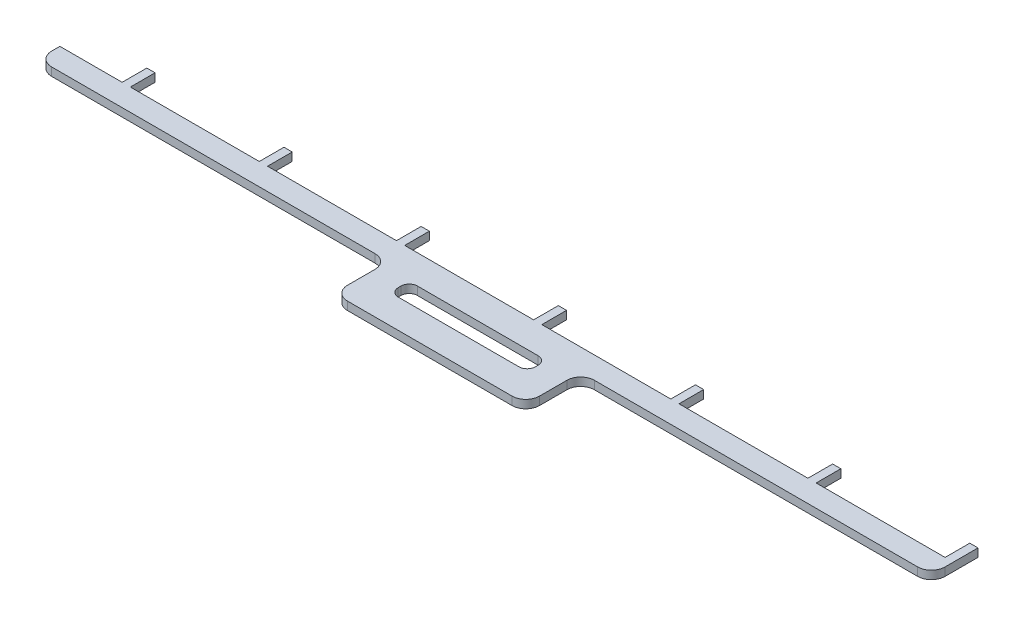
ISO-10303-21;
HEADER;
FILE_DESCRIPTION(('STEP AP214'),'2;1');
FILE_NAME('part.step','',(''),(''),'','','');
FILE_SCHEMA(('AUTOMOTIVE_DESIGN { 1 0 10303 214 1 1 1 1 }'));
ENDSEC;
DATA;
#1=APPLICATION_CONTEXT('core data for automotive mechanical design processes');
#2=APPLICATION_PROTOCOL_DEFINITION('international standard','automotive_design',2000,#1);
#3=PRODUCT_CONTEXT('',#1,'mechanical');
#4=PRODUCT('Part','Part','',(#3));
#5=PRODUCT_RELATED_PRODUCT_CATEGORY('part','',(#4));
#6=PRODUCT_DEFINITION_FORMATION('','',#4);
#7=PRODUCT_DEFINITION_CONTEXT('part definition',#1,'design');
#8=PRODUCT_DEFINITION('design','',#6,#7);
#9=PRODUCT_DEFINITION_SHAPE('','',#8);
#10=(LENGTH_UNIT() NAMED_UNIT(*) SI_UNIT(.MILLI.,.METRE.));
#11=(NAMED_UNIT(*) PLANE_ANGLE_UNIT() SI_UNIT($,.RADIAN.));
#12=(NAMED_UNIT(*) SI_UNIT($,.STERADIAN.) SOLID_ANGLE_UNIT());
#13=UNCERTAINTY_MEASURE_WITH_UNIT(LENGTH_MEASURE(1.E-05),#10,'distance_accuracy_value','');
#14=(GEOMETRIC_REPRESENTATION_CONTEXT(3) GLOBAL_UNCERTAINTY_ASSIGNED_CONTEXT((#13)) GLOBAL_UNIT_ASSIGNED_CONTEXT((#10,
#11,#12)) REPRESENTATION_CONTEXT('',''));
#15=CARTESIAN_POINT('',(0.,0.,0.));
#16=DIRECTION('',(0.,0.,1.));
#17=DIRECTION('',(1.,0.,0.));
#18=AXIS2_PLACEMENT_3D('',#15,#16,#17);
#19=CARTESIAN_POINT('',(-170.7,-131.,5.9));
#20=DIRECTION('',(0.,1.,0.));
#21=DIRECTION('',(-1.,0.,0.));
#22=AXIS2_PLACEMENT_3D('',#19,#20,#21);
#23=PLANE('',#22);
#24=DIRECTION('',(-1.,0.,0.));
#25=VECTOR('',#24,1.);
#26=CARTESIAN_POINT('',(-153.,-131.,2.9));
#27=LINE('',#26,#25);
#28=CARTESIAN_POINT('',(-153.,-131.,2.9));
#29=VERTEX_POINT('',#28);
#30=CARTESIAN_POINT('',(-175.7,-131.,2.9));
#31=VERTEX_POINT('',#30);
#32=EDGE_CURVE('E403',#29,#31,#27,.T.);
#33=ORIENTED_EDGE('',*,*,#32,.T.);
#34=DIRECTION('',(0.,0.,1.));
#35=VECTOR('',#34,1.);
#36=CARTESIAN_POINT('',(-175.7,-131.,2.9));
#37=LINE('',#36,#35);
#38=CARTESIAN_POINT('',(-175.7,-131.,5.9));
#39=VERTEX_POINT('',#38);
#40=EDGE_CURVE('E406',#31,#39,#37,.T.);
#41=ORIENTED_EDGE('',*,*,#40,.T.);
#42=CARTESIAN_POINT('',(-170.7,-131.,5.9));
#43=DIRECTION('',(0.,1.,0.));
#44=DIRECTION('',(-1.,0.,0.));
#45=AXIS2_PLACEMENT_3D('',#42,#43,#44);
#46=CIRCLE('',#45,4.99999999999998);
#47=CARTESIAN_POINT('',(-170.7,-131.,10.9));
#48=VERTEX_POINT('',#47);
#49=EDGE_CURVE('E409',#39,#48,#46,.T.);
#50=ORIENTED_EDGE('',*,*,#49,.T.);
#51=DIRECTION('',(1.,0.,0.));
#52=VECTOR('',#51,1.);
#53=CARTESIAN_POINT('',(-170.7,-131.,10.9));
#54=LINE('',#53,#52);
#55=CARTESIAN_POINT('',(-52.8500000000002,-131.,10.9));
#56=VERTEX_POINT('',#55);
#57=EDGE_CURVE('E411',#48,#56,#54,.T.);
#58=ORIENTED_EDGE('',*,*,#57,.T.);
#59=CARTESIAN_POINT('',(-52.8500000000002,-131.,15.9));
#60=DIRECTION('',(0.,-1.,0.));
#61=DIRECTION('',(1.,0.,0.));
#62=AXIS2_PLACEMENT_3D('',#59,#60,#61);
#63=CIRCLE('',#62,5.);
#64=CARTESIAN_POINT('',(-47.8500000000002,-131.,15.9));
#65=VERTEX_POINT('',#64);
#66=EDGE_CURVE('E413',#56,#65,#63,.T.);
#67=ORIENTED_EDGE('',*,*,#66,.T.);
#68=DIRECTION('',(0.,0.,1.));
#69=VECTOR('',#68,1.);
#70=CARTESIAN_POINT('',(-47.8500000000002,-131.,15.9));
#71=LINE('',#70,#69);
#72=CARTESIAN_POINT('',(-47.8500000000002,-131.,25.9));
#73=VERTEX_POINT('',#72);
#74=EDGE_CURVE('E415',#65,#73,#71,.T.);
#75=ORIENTED_EDGE('',*,*,#74,.T.);
#76=CARTESIAN_POINT('',(-42.8500000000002,-131.,25.9));
#77=DIRECTION('',(0.,1.,0.));
#78=DIRECTION('',(-1.,0.,0.));
#79=AXIS2_PLACEMENT_3D('',#76,#77,#78);
#80=CIRCLE('',#79,5.);
#81=CARTESIAN_POINT('',(-42.8500000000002,-131.,30.9));
#82=VERTEX_POINT('',#81);
#83=EDGE_CURVE('E417',#73,#82,#80,.T.);
#84=ORIENTED_EDGE('',*,*,#83,.T.);
#85=DIRECTION('',(1.,0.,0.));
#86=VECTOR('',#85,1.);
#87=CARTESIAN_POINT('',(-42.8500000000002,-131.,30.9));
#88=LINE('',#87,#86);
#89=CARTESIAN_POINT('',(17.1499999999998,-131.,30.9));
#90=VERTEX_POINT('',#89);
#91=EDGE_CURVE('E419',#82,#90,#88,.T.);
#92=ORIENTED_EDGE('',*,*,#91,.T.);
#93=CARTESIAN_POINT('',(17.1499999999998,-131.,25.9));
#94=DIRECTION('',(0.,1.,0.));
#95=DIRECTION('',(-1.,0.,0.));
#96=AXIS2_PLACEMENT_3D('',#93,#94,#95);
#97=CIRCLE('',#96,5.);
#98=CARTESIAN_POINT('',(22.1499999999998,-131.,25.9));
#99=VERTEX_POINT('',#98);
#100=EDGE_CURVE('E421',#90,#99,#97,.T.);
#101=ORIENTED_EDGE('',*,*,#100,.T.);
#102=DIRECTION('',(0.,0.,-1.));
#103=VECTOR('',#102,1.);
#104=CARTESIAN_POINT('',(22.1499999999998,-131.,15.9));
#105=LINE('',#104,#103);
#106=CARTESIAN_POINT('',(22.1499999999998,-131.,15.9));
#107=VERTEX_POINT('',#106);
#108=EDGE_CURVE('E423',#99,#107,#105,.T.);
#109=ORIENTED_EDGE('',*,*,#108,.T.);
#110=CARTESIAN_POINT('',(27.1499999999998,-131.,15.9));
#111=DIRECTION('',(0.,-1.,0.));
#112=DIRECTION('',(-1.,0.,0.));
#113=AXIS2_PLACEMENT_3D('',#110,#111,#112);
#114=CIRCLE('',#113,5.);
#115=CARTESIAN_POINT('',(27.1499999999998,-131.,10.9));
#116=VERTEX_POINT('',#115);
#117=EDGE_CURVE('E425',#107,#116,#114,.T.);
#118=ORIENTED_EDGE('',*,*,#117,.T.);
#119=DIRECTION('',(1.,0.,0.));
#120=VECTOR('',#119,1.);
#121=CARTESIAN_POINT('',(27.1499999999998,-131.,10.9));
#122=LINE('',#121,#120);
#123=CARTESIAN_POINT('',(145.,-131.,10.9));
#124=VERTEX_POINT('',#123);
#125=EDGE_CURVE('E427',#116,#124,#122,.T.);
#126=ORIENTED_EDGE('',*,*,#125,.T.);
#127=CARTESIAN_POINT('',(145.,-131.,5.9));
#128=DIRECTION('',(0.,1.,0.));
#129=DIRECTION('',(-1.,0.,0.));
#130=AXIS2_PLACEMENT_3D('',#127,#128,#129);
#131=CIRCLE('',#130,5.);
#132=CARTESIAN_POINT('',(150.,-131.,5.9));
#133=VERTEX_POINT('',#132);
#134=EDGE_CURVE('E429',#124,#133,#131,.T.);
#135=ORIENTED_EDGE('',*,*,#134,.T.);
#136=DIRECTION('',(0.,0.,-1.));
#137=VECTOR('',#136,1.);
#138=CARTESIAN_POINT('',(150.,-131.,2.9));
#139=LINE('',#138,#137);
#140=CARTESIAN_POINT('',(150.,-131.,-6.1));
#141=VERTEX_POINT('',#140);
#142=EDGE_CURVE('E431',#133,#141,#139,.T.);
#143=ORIENTED_EDGE('',*,*,#142,.T.);
#144=DIRECTION('',(-1.,0.,0.));
#145=VECTOR('',#144,1.);
#146=CARTESIAN_POINT('',(150.,-131.,-6.1));
#147=LINE('',#146,#145);
#148=CARTESIAN_POINT('',(147.,-131.,-6.1));
#149=VERTEX_POINT('',#148);
#150=EDGE_CURVE('E433',#141,#149,#147,.T.);
#151=ORIENTED_EDGE('',*,*,#150,.T.);
#152=DIRECTION('',(0.,0.,1.));
#153=VECTOR('',#152,1.);
#154=CARTESIAN_POINT('',(147.,-131.,-6.1));
#155=LINE('',#154,#153);
#156=CARTESIAN_POINT('',(147.,-131.,2.9));
#157=VERTEX_POINT('',#156);
#158=EDGE_CURVE('E435',#149,#157,#155,.T.);
#159=ORIENTED_EDGE('',*,*,#158,.T.);
#160=DIRECTION('',(-1.,0.,0.));
#161=VECTOR('',#160,1.);
#162=CARTESIAN_POINT('',(147.,-131.,2.9));
#163=LINE('',#162,#161);
#164=CARTESIAN_POINT('',(100.,-131.,2.9));
#165=VERTEX_POINT('',#164);
#166=EDGE_CURVE('E437',#157,#165,#163,.T.);
#167=ORIENTED_EDGE('',*,*,#166,.T.);
#168=DIRECTION('',(0.,0.,-1.));
#169=VECTOR('',#168,1.);
#170=CARTESIAN_POINT('',(100.,-131.,2.9));
#171=LINE('',#170,#169);
#172=CARTESIAN_POINT('',(100.,-131.,-6.1));
#173=VERTEX_POINT('',#172);
#174=EDGE_CURVE('E439',#165,#173,#171,.T.);
#175=ORIENTED_EDGE('',*,*,#174,.T.);
#176=DIRECTION('',(-1.,0.,0.));
#177=VECTOR('',#176,1.);
#178=CARTESIAN_POINT('',(100.,-131.,-6.1));
#179=LINE('',#178,#177);
#180=CARTESIAN_POINT('',(97.0000000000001,-131.,-6.1));
#181=VERTEX_POINT('',#180);
#182=EDGE_CURVE('E441',#173,#181,#179,.T.);
#183=ORIENTED_EDGE('',*,*,#182,.T.);
#184=DIRECTION('',(0.,0.,1.));
#185=VECTOR('',#184,1.);
#186=CARTESIAN_POINT('',(97.0000000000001,-131.,-6.1));
#187=LINE('',#186,#185);
#188=CARTESIAN_POINT('',(97.0000000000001,-131.,2.9));
#189=VERTEX_POINT('',#188);
#190=EDGE_CURVE('E443',#181,#189,#187,.T.);
#191=ORIENTED_EDGE('',*,*,#190,.T.);
#192=DIRECTION('',(-1.,0.,0.));
#193=VECTOR('',#192,1.);
#194=CARTESIAN_POINT('',(97.0000000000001,-131.,2.9));
#195=LINE('',#194,#193);
#196=CARTESIAN_POINT('',(50.0000000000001,-131.,2.9));
#197=VERTEX_POINT('',#196);
#198=EDGE_CURVE('E445',#189,#197,#195,.T.);
#199=ORIENTED_EDGE('',*,*,#198,.T.);
#200=DIRECTION('',(0.,0.,-1.));
#201=VECTOR('',#200,1.);
#202=CARTESIAN_POINT('',(50.0000000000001,-131.,2.9));
#203=LINE('',#202,#201);
#204=CARTESIAN_POINT('',(50.0000000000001,-131.,-6.1));
#205=VERTEX_POINT('',#204);
#206=EDGE_CURVE('E447',#197,#205,#203,.T.);
#207=ORIENTED_EDGE('',*,*,#206,.T.);
#208=DIRECTION('',(-1.,0.,0.));
#209=VECTOR('',#208,1.);
#210=CARTESIAN_POINT('',(50.0000000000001,-131.,-6.1));
#211=LINE('',#210,#209);
#212=CARTESIAN_POINT('',(47.0000000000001,-131.,-6.1));
#213=VERTEX_POINT('',#212);
#214=EDGE_CURVE('E449',#205,#213,#211,.T.);
#215=ORIENTED_EDGE('',*,*,#214,.T.);
#216=DIRECTION('',(0.,0.,1.));
#217=VECTOR('',#216,1.);
#218=CARTESIAN_POINT('',(47.0000000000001,-131.,-6.1));
#219=LINE('',#218,#217);
#220=CARTESIAN_POINT('',(47.0000000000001,-131.,2.9));
#221=VERTEX_POINT('',#220);
#222=EDGE_CURVE('E451',#213,#221,#219,.T.);
#223=ORIENTED_EDGE('',*,*,#222,.T.);
#224=DIRECTION('',(-1.,0.,0.));
#225=VECTOR('',#224,1.);
#226=CARTESIAN_POINT('',(47.0000000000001,-131.,2.9));
#227=LINE('',#226,#225);
#228=CARTESIAN_POINT('',(0.,-131.,2.9));
#229=VERTEX_POINT('',#228);
#230=EDGE_CURVE('E453',#221,#229,#227,.T.);
#231=ORIENTED_EDGE('',*,*,#230,.T.);
#232=DIRECTION('',(0.,0.,-1.));
#233=VECTOR('',#232,1.);
#234=CARTESIAN_POINT('',(0.,-131.,2.9));
#235=LINE('',#234,#233);
#236=CARTESIAN_POINT('',(0.,-131.,-6.1));
#237=VERTEX_POINT('',#236);
#238=EDGE_CURVE('E455',#229,#237,#235,.T.);
#239=ORIENTED_EDGE('',*,*,#238,.T.);
#240=DIRECTION('',(-1.,0.,0.));
#241=VECTOR('',#240,1.);
#242=CARTESIAN_POINT('',(0.,-131.,-6.1));
#243=LINE('',#242,#241);
#244=CARTESIAN_POINT('',(-3.00000000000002,-131.,-6.1));
#245=VERTEX_POINT('',#244);
#246=EDGE_CURVE('E457',#237,#245,#243,.T.);
#247=ORIENTED_EDGE('',*,*,#246,.T.);
#248=DIRECTION('',(0.,0.,1.));
#249=VECTOR('',#248,1.);
#250=CARTESIAN_POINT('',(-3.00000000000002,-131.,-6.1));
#251=LINE('',#250,#249);
#252=CARTESIAN_POINT('',(-3.00000000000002,-131.,2.9));
#253=VERTEX_POINT('',#252);
#254=EDGE_CURVE('E459',#245,#253,#251,.T.);
#255=ORIENTED_EDGE('',*,*,#254,.T.);
#256=DIRECTION('',(-1.,0.,0.));
#257=VECTOR('',#256,1.);
#258=CARTESIAN_POINT('',(-3.00000000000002,-131.,2.9));
#259=LINE('',#258,#257);
#260=CARTESIAN_POINT('',(-50.,-131.,2.9));
#261=VERTEX_POINT('',#260);
#262=EDGE_CURVE('E461',#253,#261,#259,.T.);
#263=ORIENTED_EDGE('',*,*,#262,.T.);
#264=DIRECTION('',(0.,0.,-1.));
#265=VECTOR('',#264,1.);
#266=CARTESIAN_POINT('',(-50.,-131.,2.9));
#267=LINE('',#266,#265);
#268=CARTESIAN_POINT('',(-50.,-131.,-6.1));
#269=VERTEX_POINT('',#268);
#270=EDGE_CURVE('E463',#261,#269,#267,.T.);
#271=ORIENTED_EDGE('',*,*,#270,.T.);
#272=DIRECTION('',(-1.,0.,0.));
#273=VECTOR('',#272,1.);
#274=CARTESIAN_POINT('',(-50.,-131.,-6.1));
#275=LINE('',#274,#273);
#276=CARTESIAN_POINT('',(-53.,-131.,-6.1));
#277=VERTEX_POINT('',#276);
#278=EDGE_CURVE('E465',#269,#277,#275,.T.);
#279=ORIENTED_EDGE('',*,*,#278,.T.);
#280=DIRECTION('',(0.,0.,1.));
#281=VECTOR('',#280,1.);
#282=CARTESIAN_POINT('',(-53.,-131.,-6.1));
#283=LINE('',#282,#281);
#284=CARTESIAN_POINT('',(-53.,-131.,2.9));
#285=VERTEX_POINT('',#284);
#286=EDGE_CURVE('E467',#277,#285,#283,.T.);
#287=ORIENTED_EDGE('',*,*,#286,.T.);
#288=DIRECTION('',(-1.,0.,0.));
#289=VECTOR('',#288,1.);
#290=CARTESIAN_POINT('',(-53.,-131.,2.9));
#291=LINE('',#290,#289);
#292=CARTESIAN_POINT('',(-100.,-131.,2.9));
#293=VERTEX_POINT('',#292);
#294=EDGE_CURVE('E469',#285,#293,#291,.T.);
#295=ORIENTED_EDGE('',*,*,#294,.T.);
#296=DIRECTION('',(0.,0.,-1.));
#297=VECTOR('',#296,1.);
#298=CARTESIAN_POINT('',(-100.,-131.,2.9));
#299=LINE('',#298,#297);
#300=CARTESIAN_POINT('',(-100.,-131.,-6.1));
#301=VERTEX_POINT('',#300);
#302=EDGE_CURVE('E471',#293,#301,#299,.T.);
#303=ORIENTED_EDGE('',*,*,#302,.T.);
#304=DIRECTION('',(-1.,0.,0.));
#305=VECTOR('',#304,1.);
#306=CARTESIAN_POINT('',(-100.,-131.,-6.1));
#307=LINE('',#306,#305);
#308=CARTESIAN_POINT('',(-103.,-131.,-6.1));
#309=VERTEX_POINT('',#308);
#310=EDGE_CURVE('E473',#301,#309,#307,.T.);
#311=ORIENTED_EDGE('',*,*,#310,.T.);
#312=DIRECTION('',(0.,0.,1.));
#313=VECTOR('',#312,1.);
#314=CARTESIAN_POINT('',(-103.,-131.,-6.1));
#315=LINE('',#314,#313);
#316=CARTESIAN_POINT('',(-103.,-131.,2.9));
#317=VERTEX_POINT('',#316);
#318=EDGE_CURVE('E475',#309,#317,#315,.T.);
#319=ORIENTED_EDGE('',*,*,#318,.T.);
#320=DIRECTION('',(-1.,0.,0.));
#321=VECTOR('',#320,1.);
#322=CARTESIAN_POINT('',(-103.,-131.,2.9));
#323=LINE('',#322,#321);
#324=CARTESIAN_POINT('',(-150.,-131.,2.9));
#325=VERTEX_POINT('',#324);
#326=EDGE_CURVE('E477',#317,#325,#323,.T.);
#327=ORIENTED_EDGE('',*,*,#326,.T.);
#328=DIRECTION('',(0.,0.,-1.));
#329=VECTOR('',#328,1.);
#330=CARTESIAN_POINT('',(-150.,-131.,2.9));
#331=LINE('',#330,#329);
#332=CARTESIAN_POINT('',(-150.,-131.,-6.1));
#333=VERTEX_POINT('',#332);
#334=EDGE_CURVE('E479',#325,#333,#331,.T.);
#335=ORIENTED_EDGE('',*,*,#334,.T.);
#336=DIRECTION('',(-1.,0.,0.));
#337=VECTOR('',#336,1.);
#338=CARTESIAN_POINT('',(-150.,-131.,-6.1));
#339=LINE('',#338,#337);
#340=CARTESIAN_POINT('',(-153.,-131.,-6.1));
#341=VERTEX_POINT('',#340);
#342=EDGE_CURVE('E481',#333,#341,#339,.T.);
#343=ORIENTED_EDGE('',*,*,#342,.T.);
#344=DIRECTION('',(0.,0.,1.));
#345=VECTOR('',#344,1.);
#346=CARTESIAN_POINT('',(-153.,-131.,-6.1));
#347=LINE('',#346,#345);
#348=EDGE_CURVE('E483',#341,#29,#347,.T.);
#349=ORIENTED_EDGE('',*,*,#348,.T.);
#350=EDGE_LOOP('',(#33,#41,#50,#58,#67,#75,#84,#92,#101,#109,#118,#126,#135,#143,#151,#159,#167,
#175,#183,#191,#199,#207,#215,#223,#231,#239,#247,#255,#263,#271,#279,#287,#295,#303,#311,#319,
#327,#335,#343,#349));
#351=FACE_BOUND('',#350,.T.);
#352=DIRECTION('',(-1.,0.,0.));
#353=VECTOR('',#352,1.);
#354=CARTESIAN_POINT('',(-34.8500000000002,-131.,13.4));
#355=LINE('',#354,#353);
#356=CARTESIAN_POINT('',(9.14999999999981,-131.,13.4));
#357=VERTEX_POINT('',#356);
#358=CARTESIAN_POINT('',(-34.8500000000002,-131.,13.4));
#359=VERTEX_POINT('',#358);
#360=EDGE_CURVE('E346',#357,#359,#355,.T.);
#361=ORIENTED_EDGE('',*,*,#360,.F.);
#362=CARTESIAN_POINT('',(9.14999999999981,-131.,16.4));
#363=DIRECTION('',(0.,1.,0.));
#364=DIRECTION('',(1.,0.,0.));
#365=AXIS2_PLACEMENT_3D('',#362,#363,#364);
#366=CIRCLE('',#365,3.);
#367=CARTESIAN_POINT('',(12.1499999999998,-131.,16.4));
#368=VERTEX_POINT('',#367);
#369=EDGE_CURVE('E338',#368,#357,#366,.T.);
#370=ORIENTED_EDGE('',*,*,#369,.F.);
#371=DIRECTION('',(0.,0.,-1.));
#372=VECTOR('',#371,1.);
#373=CARTESIAN_POINT('',(12.1499999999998,-131.,16.4));
#374=LINE('',#373,#372);
#375=CARTESIAN_POINT('',(12.1499999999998,-131.,17.4));
#376=VERTEX_POINT('',#375);
#377=EDGE_CURVE('E371',#376,#368,#374,.T.);
#378=ORIENTED_EDGE('',*,*,#377,.F.);
#379=CARTESIAN_POINT('',(9.14999999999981,-131.,17.4));
#380=DIRECTION('',(0.,1.,0.));
#381=DIRECTION('',(-1.,0.,0.));
#382=AXIS2_PLACEMENT_3D('',#379,#380,#381);
#383=CIRCLE('',#382,3.);
#384=CARTESIAN_POINT('',(9.14999999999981,-131.,20.4));
#385=VERTEX_POINT('',#384);
#386=EDGE_CURVE('E369',#385,#376,#383,.T.);
#387=ORIENTED_EDGE('',*,*,#386,.F.);
#388=DIRECTION('',(1.,0.,0.));
#389=VECTOR('',#388,1.);
#390=CARTESIAN_POINT('',(-34.8500000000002,-131.,20.4));
#391=LINE('',#390,#389);
#392=CARTESIAN_POINT('',(-34.8500000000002,-131.,20.4));
#393=VERTEX_POINT('',#392);
#394=EDGE_CURVE('E367',#393,#385,#391,.T.);
#395=ORIENTED_EDGE('',*,*,#394,.F.);
#396=CARTESIAN_POINT('',(-34.8500000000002,-131.,17.4));
#397=DIRECTION('',(0.,1.,0.));
#398=DIRECTION('',(-1.,0.,0.));
#399=AXIS2_PLACEMENT_3D('',#396,#397,#398);
#400=CIRCLE('',#399,3.);
#401=CARTESIAN_POINT('',(-37.8500000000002,-131.,17.4));
#402=VERTEX_POINT('',#401);
#403=EDGE_CURVE('E365',#402,#393,#400,.T.);
#404=ORIENTED_EDGE('',*,*,#403,.F.);
#405=DIRECTION('',(0.,0.,1.));
#406=VECTOR('',#405,1.);
#407=CARTESIAN_POINT('',(-37.8500000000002,-131.,16.4));
#408=LINE('',#407,#406);
#409=CARTESIAN_POINT('',(-37.8500000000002,-131.,16.4));
#410=VERTEX_POINT('',#409);
#411=EDGE_CURVE('E361',#410,#402,#408,.T.);
#412=ORIENTED_EDGE('',*,*,#411,.F.);
#413=CARTESIAN_POINT('',(-34.8500000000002,-131.,16.4));
#414=DIRECTION('',(0.,1.,0.));
#415=DIRECTION('',(-1.,0.,0.));
#416=AXIS2_PLACEMENT_3D('',#413,#414,#415);
#417=CIRCLE('',#416,3.);
#418=EDGE_CURVE('E359',#359,#410,#417,.T.);
#419=ORIENTED_EDGE('',*,*,#418,.F.);
#420=EDGE_LOOP('',(#361,#370,#378,#387,#395,#404,#412,#419));
#421=FACE_BOUND('',#420,.T.);
#422=ADVANCED_FACE('F33',(#351,#421),#23,.T.);
#423=CARTESIAN_POINT('',(-170.7,-134.,5.9));
#424=DIRECTION('',(0.,1.,0.));
#425=DIRECTION('',(-1.,0.,0.));
#426=AXIS2_PLACEMENT_3D('',#423,#424,#425);
#427=PLANE('',#426);
#428=DIRECTION('',(-1.,0.,0.));
#429=VECTOR('',#428,1.);
#430=CARTESIAN_POINT('',(-153.,-134.,2.9));
#431=LINE('',#430,#429);
#432=CARTESIAN_POINT('',(-153.,-134.,2.9));
#433=VERTEX_POINT('',#432);
#434=CARTESIAN_POINT('',(-175.7,-134.,2.9));
#435=VERTEX_POINT('',#434);
#436=EDGE_CURVE('E354',#433,#435,#431,.T.);
#437=ORIENTED_EDGE('',*,*,#436,.F.);
#438=DIRECTION('',(0.,0.,1.));
#439=VECTOR('',#438,1.);
#440=CARTESIAN_POINT('',(-153.,-134.,-6.1));
#441=LINE('',#440,#439);
#442=CARTESIAN_POINT('',(-153.,-134.,-6.1));
#443=VERTEX_POINT('',#442);
#444=EDGE_CURVE('E407',#443,#433,#441,.T.);
#445=ORIENTED_EDGE('',*,*,#444,.F.);
#446=DIRECTION('',(-1.,0.,0.));
#447=VECTOR('',#446,1.);
#448=CARTESIAN_POINT('',(-150.,-134.,-6.1));
#449=LINE('',#448,#447);
#450=CARTESIAN_POINT('',(-150.,-134.,-6.1));
#451=VERTEX_POINT('',#450);
#452=EDGE_CURVE('E563',#451,#443,#449,.T.);
#453=ORIENTED_EDGE('',*,*,#452,.F.);
#454=DIRECTION('',(0.,0.,-1.));
#455=VECTOR('',#454,1.);
#456=CARTESIAN_POINT('',(-150.,-134.,2.9));
#457=LINE('',#456,#455);
#458=CARTESIAN_POINT('',(-150.,-134.,2.9));
#459=VERTEX_POINT('',#458);
#460=EDGE_CURVE('E561',#459,#451,#457,.T.);
#461=ORIENTED_EDGE('',*,*,#460,.F.);
#462=DIRECTION('',(-1.,0.,0.));
#463=VECTOR('',#462,1.);
#464=CARTESIAN_POINT('',(-103.,-134.,2.9));
#465=LINE('',#464,#463);
#466=CARTESIAN_POINT('',(-103.,-134.,2.9));
#467=VERTEX_POINT('',#466);
#468=EDGE_CURVE('E559',#467,#459,#465,.T.);
#469=ORIENTED_EDGE('',*,*,#468,.F.);
#470=DIRECTION('',(0.,0.,1.));
#471=VECTOR('',#470,1.);
#472=CARTESIAN_POINT('',(-103.,-134.,-6.1));
#473=LINE('',#472,#471);
#474=CARTESIAN_POINT('',(-103.,-134.,-6.1));
#475=VERTEX_POINT('',#474);
#476=EDGE_CURVE('E557',#475,#467,#473,.T.);
#477=ORIENTED_EDGE('',*,*,#476,.F.);
#478=DIRECTION('',(-1.,0.,0.));
#479=VECTOR('',#478,1.);
#480=CARTESIAN_POINT('',(-100.,-134.,-6.1));
#481=LINE('',#480,#479);
#482=CARTESIAN_POINT('',(-100.,-134.,-6.1));
#483=VERTEX_POINT('',#482);
#484=EDGE_CURVE('E555',#483,#475,#481,.T.);
#485=ORIENTED_EDGE('',*,*,#484,.F.);
#486=DIRECTION('',(0.,0.,-1.));
#487=VECTOR('',#486,1.);
#488=CARTESIAN_POINT('',(-100.,-134.,2.9));
#489=LINE('',#488,#487);
#490=CARTESIAN_POINT('',(-100.,-134.,2.9));
#491=VERTEX_POINT('',#490);
#492=EDGE_CURVE('E553',#491,#483,#489,.T.);
#493=ORIENTED_EDGE('',*,*,#492,.F.);
#494=DIRECTION('',(-1.,0.,0.));
#495=VECTOR('',#494,1.);
#496=CARTESIAN_POINT('',(-53.,-134.,2.9));
#497=LINE('',#496,#495);
#498=CARTESIAN_POINT('',(-53.,-134.,2.9));
#499=VERTEX_POINT('',#498);
#500=EDGE_CURVE('E551',#499,#491,#497,.T.);
#501=ORIENTED_EDGE('',*,*,#500,.F.);
#502=DIRECTION('',(0.,0.,1.));
#503=VECTOR('',#502,1.);
#504=CARTESIAN_POINT('',(-53.,-134.,-6.1));
#505=LINE('',#504,#503);
#506=CARTESIAN_POINT('',(-53.,-134.,-6.1));
#507=VERTEX_POINT('',#506);
#508=EDGE_CURVE('E549',#507,#499,#505,.T.);
#509=ORIENTED_EDGE('',*,*,#508,.F.);
#510=DIRECTION('',(-1.,0.,0.));
#511=VECTOR('',#510,1.);
#512=CARTESIAN_POINT('',(-50.,-134.,-6.1));
#513=LINE('',#512,#511);
#514=CARTESIAN_POINT('',(-50.,-134.,-6.1));
#515=VERTEX_POINT('',#514);
#516=EDGE_CURVE('E547',#515,#507,#513,.T.);
#517=ORIENTED_EDGE('',*,*,#516,.F.);
#518=DIRECTION('',(0.,0.,-1.));
#519=VECTOR('',#518,1.);
#520=CARTESIAN_POINT('',(-50.,-134.,2.9));
#521=LINE('',#520,#519);
#522=CARTESIAN_POINT('',(-50.,-134.,2.9));
#523=VERTEX_POINT('',#522);
#524=EDGE_CURVE('E545',#523,#515,#521,.T.);
#525=ORIENTED_EDGE('',*,*,#524,.F.);
#526=DIRECTION('',(-1.,0.,0.));
#527=VECTOR('',#526,1.);
#528=CARTESIAN_POINT('',(-3.00000000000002,-134.,2.9));
#529=LINE('',#528,#527);
#530=CARTESIAN_POINT('',(-3.00000000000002,-134.,2.9));
#531=VERTEX_POINT('',#530);
#532=EDGE_CURVE('E543',#531,#523,#529,.T.);
#533=ORIENTED_EDGE('',*,*,#532,.F.);
#534=DIRECTION('',(0.,0.,1.));
#535=VECTOR('',#534,1.);
#536=CARTESIAN_POINT('',(-3.00000000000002,-134.,-6.1));
#537=LINE('',#536,#535);
#538=CARTESIAN_POINT('',(-3.00000000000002,-134.,-6.1));
#539=VERTEX_POINT('',#538);
#540=EDGE_CURVE('E541',#539,#531,#537,.T.);
#541=ORIENTED_EDGE('',*,*,#540,.F.);
#542=DIRECTION('',(-1.,0.,0.));
#543=VECTOR('',#542,1.);
#544=CARTESIAN_POINT('',(0.,-134.,-6.1));
#545=LINE('',#544,#543);
#546=CARTESIAN_POINT('',(0.,-134.,-6.1));
#547=VERTEX_POINT('',#546);
#548=EDGE_CURVE('E539',#547,#539,#545,.T.);
#549=ORIENTED_EDGE('',*,*,#548,.F.);
#550=DIRECTION('',(0.,0.,-1.));
#551=VECTOR('',#550,1.);
#552=CARTESIAN_POINT('',(0.,-134.,2.9));
#553=LINE('',#552,#551);
#554=CARTESIAN_POINT('',(0.,-134.,2.9));
#555=VERTEX_POINT('',#554);
#556=EDGE_CURVE('E537',#555,#547,#553,.T.);
#557=ORIENTED_EDGE('',*,*,#556,.F.);
#558=DIRECTION('',(-1.,0.,0.));
#559=VECTOR('',#558,1.);
#560=CARTESIAN_POINT('',(47.0000000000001,-134.,2.9));
#561=LINE('',#560,#559);
#562=CARTESIAN_POINT('',(47.0000000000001,-134.,2.9));
#563=VERTEX_POINT('',#562);
#564=EDGE_CURVE('E535',#563,#555,#561,.T.);
#565=ORIENTED_EDGE('',*,*,#564,.F.);
#566=DIRECTION('',(0.,0.,1.));
#567=VECTOR('',#566,1.);
#568=CARTESIAN_POINT('',(47.0000000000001,-134.,-6.1));
#569=LINE('',#568,#567);
#570=CARTESIAN_POINT('',(47.0000000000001,-134.,-6.1));
#571=VERTEX_POINT('',#570);
#572=EDGE_CURVE('E533',#571,#563,#569,.T.);
#573=ORIENTED_EDGE('',*,*,#572,.F.);
#574=DIRECTION('',(-1.,0.,0.));
#575=VECTOR('',#574,1.);
#576=CARTESIAN_POINT('',(50.0000000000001,-134.,-6.1));
#577=LINE('',#576,#575);
#578=CARTESIAN_POINT('',(50.0000000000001,-134.,-6.1));
#579=VERTEX_POINT('',#578);
#580=EDGE_CURVE('E531',#579,#571,#577,.T.);
#581=ORIENTED_EDGE('',*,*,#580,.F.);
#582=DIRECTION('',(0.,0.,-1.));
#583=VECTOR('',#582,1.);
#584=CARTESIAN_POINT('',(50.0000000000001,-134.,2.9));
#585=LINE('',#584,#583);
#586=CARTESIAN_POINT('',(50.0000000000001,-134.,2.9));
#587=VERTEX_POINT('',#586);
#588=EDGE_CURVE('E529',#587,#579,#585,.T.);
#589=ORIENTED_EDGE('',*,*,#588,.F.);
#590=DIRECTION('',(-1.,0.,0.));
#591=VECTOR('',#590,1.);
#592=CARTESIAN_POINT('',(97.0000000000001,-134.,2.9));
#593=LINE('',#592,#591);
#594=CARTESIAN_POINT('',(97.0000000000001,-134.,2.9));
#595=VERTEX_POINT('',#594);
#596=EDGE_CURVE('E527',#595,#587,#593,.T.);
#597=ORIENTED_EDGE('',*,*,#596,.F.);
#598=DIRECTION('',(0.,0.,1.));
#599=VECTOR('',#598,1.);
#600=CARTESIAN_POINT('',(97.0000000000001,-134.,-6.1));
#601=LINE('',#600,#599);
#602=CARTESIAN_POINT('',(97.0000000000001,-134.,-6.1));
#603=VERTEX_POINT('',#602);
#604=EDGE_CURVE('E525',#603,#595,#601,.T.);
#605=ORIENTED_EDGE('',*,*,#604,.F.);
#606=DIRECTION('',(-1.,0.,0.));
#607=VECTOR('',#606,1.);
#608=CARTESIAN_POINT('',(100.,-134.,-6.1));
#609=LINE('',#608,#607);
#610=CARTESIAN_POINT('',(100.,-134.,-6.1));
#611=VERTEX_POINT('',#610);
#612=EDGE_CURVE('E523',#611,#603,#609,.T.);
#613=ORIENTED_EDGE('',*,*,#612,.F.);
#614=DIRECTION('',(0.,0.,-1.));
#615=VECTOR('',#614,1.);
#616=CARTESIAN_POINT('',(100.,-134.,2.9));
#617=LINE('',#616,#615);
#618=CARTESIAN_POINT('',(100.,-134.,2.9));
#619=VERTEX_POINT('',#618);
#620=EDGE_CURVE('E521',#619,#611,#617,.T.);
#621=ORIENTED_EDGE('',*,*,#620,.F.);
#622=DIRECTION('',(-1.,0.,0.));
#623=VECTOR('',#622,1.);
#624=CARTESIAN_POINT('',(147.,-134.,2.9));
#625=LINE('',#624,#623);
#626=CARTESIAN_POINT('',(147.,-134.,2.9));
#627=VERTEX_POINT('',#626);
#628=EDGE_CURVE('E519',#627,#619,#625,.T.);
#629=ORIENTED_EDGE('',*,*,#628,.F.);
#630=DIRECTION('',(0.,0.,1.));
#631=VECTOR('',#630,1.);
#632=CARTESIAN_POINT('',(147.,-134.,-6.1));
#633=LINE('',#632,#631);
#634=CARTESIAN_POINT('',(147.,-134.,-6.1));
#635=VERTEX_POINT('',#634);
#636=EDGE_CURVE('E517',#635,#627,#633,.T.);
#637=ORIENTED_EDGE('',*,*,#636,.F.);
#638=DIRECTION('',(-1.,0.,0.));
#639=VECTOR('',#638,1.);
#640=CARTESIAN_POINT('',(150.,-134.,-6.1));
#641=LINE('',#640,#639);
#642=CARTESIAN_POINT('',(150.,-134.,-6.1));
#643=VERTEX_POINT('',#642);
#644=EDGE_CURVE('E515',#643,#635,#641,.T.);
#645=ORIENTED_EDGE('',*,*,#644,.F.);
#646=DIRECTION('',(0.,0.,-1.));
#647=VECTOR('',#646,1.);
#648=CARTESIAN_POINT('',(150.,-134.,2.9));
#649=LINE('',#648,#647);
#650=CARTESIAN_POINT('',(150.,-134.,5.9));
#651=VERTEX_POINT('',#650);
#652=EDGE_CURVE('E513',#651,#643,#649,.T.);
#653=ORIENTED_EDGE('',*,*,#652,.F.);
#654=CARTESIAN_POINT('',(145.,-134.,5.9));
#655=DIRECTION('',(0.,1.,0.));
#656=DIRECTION('',(-1.,0.,0.));
#657=AXIS2_PLACEMENT_3D('',#654,#655,#656);
#658=CIRCLE('',#657,5.);
#659=CARTESIAN_POINT('',(145.,-134.,10.9));
#660=VERTEX_POINT('',#659);
#661=EDGE_CURVE('E510',#660,#651,#658,.T.);
#662=ORIENTED_EDGE('',*,*,#661,.F.);
#663=DIRECTION('',(1.,0.,0.));
#664=VECTOR('',#663,1.);
#665=CARTESIAN_POINT('',(27.1499999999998,-134.,10.9));
#666=LINE('',#665,#664);
#667=CARTESIAN_POINT('',(27.1499999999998,-134.,10.9));
#668=VERTEX_POINT('',#667);
#669=EDGE_CURVE('E508',#668,#660,#666,.T.);
#670=ORIENTED_EDGE('',*,*,#669,.F.);
#671=CARTESIAN_POINT('',(27.1499999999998,-134.,15.9));
#672=DIRECTION('',(0.,-1.,0.));
#673=DIRECTION('',(-1.,0.,0.));
#674=AXIS2_PLACEMENT_3D('',#671,#672,#673);
#675=CIRCLE('',#674,5.);
#676=CARTESIAN_POINT('',(22.1499999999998,-134.,15.9));
#677=VERTEX_POINT('',#676);
#678=EDGE_CURVE('E506',#677,#668,#675,.T.);
#679=ORIENTED_EDGE('',*,*,#678,.F.);
#680=DIRECTION('',(0.,0.,-1.));
#681=VECTOR('',#680,1.);
#682=CARTESIAN_POINT('',(22.1499999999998,-134.,15.9));
#683=LINE('',#682,#681);
#684=CARTESIAN_POINT('',(22.1499999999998,-134.,25.9));
#685=VERTEX_POINT('',#684);
#686=EDGE_CURVE('E504',#685,#677,#683,.T.);
#687=ORIENTED_EDGE('',*,*,#686,.F.);
#688=CARTESIAN_POINT('',(17.1499999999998,-134.,25.9));
#689=DIRECTION('',(0.,1.,0.));
#690=DIRECTION('',(-1.,0.,0.));
#691=AXIS2_PLACEMENT_3D('',#688,#689,#690);
#692=CIRCLE('',#691,5.);
#693=CARTESIAN_POINT('',(17.1499999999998,-134.,30.9));
#694=VERTEX_POINT('',#693);
#695=EDGE_CURVE('E502',#694,#685,#692,.T.);
#696=ORIENTED_EDGE('',*,*,#695,.F.);
#697=DIRECTION('',(1.,0.,0.));
#698=VECTOR('',#697,1.);
#699=CARTESIAN_POINT('',(-42.8500000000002,-134.,30.9));
#700=LINE('',#699,#698);
#701=CARTESIAN_POINT('',(-42.8500000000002,-134.,30.9));
#702=VERTEX_POINT('',#701);
#703=EDGE_CURVE('E500',#702,#694,#700,.T.);
#704=ORIENTED_EDGE('',*,*,#703,.F.);
#705=CARTESIAN_POINT('',(-42.8500000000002,-134.,25.9));
#706=DIRECTION('',(0.,1.,0.));
#707=DIRECTION('',(-1.,0.,0.));
#708=AXIS2_PLACEMENT_3D('',#705,#706,#707);
#709=CIRCLE('',#708,5.);
#710=CARTESIAN_POINT('',(-47.8500000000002,-134.,25.9));
#711=VERTEX_POINT('',#710);
#712=EDGE_CURVE('E498',#711,#702,#709,.T.);
#713=ORIENTED_EDGE('',*,*,#712,.F.);
#714=DIRECTION('',(0.,0.,1.));
#715=VECTOR('',#714,1.);
#716=CARTESIAN_POINT('',(-47.8500000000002,-134.,15.9));
#717=LINE('',#716,#715);
#718=CARTESIAN_POINT('',(-47.8500000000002,-134.,15.9));
#719=VERTEX_POINT('',#718);
#720=EDGE_CURVE('E496',#719,#711,#717,.T.);
#721=ORIENTED_EDGE('',*,*,#720,.F.);
#722=CARTESIAN_POINT('',(-52.8500000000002,-134.,15.9));
#723=DIRECTION('',(0.,-1.,0.));
#724=DIRECTION('',(1.,0.,0.));
#725=AXIS2_PLACEMENT_3D('',#722,#723,#724);
#726=CIRCLE('',#725,5.);
#727=CARTESIAN_POINT('',(-52.8500000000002,-134.,10.9));
#728=VERTEX_POINT('',#727);
#729=EDGE_CURVE('E494',#728,#719,#726,.T.);
#730=ORIENTED_EDGE('',*,*,#729,.F.);
#731=DIRECTION('',(1.,0.,0.));
#732=VECTOR('',#731,1.);
#733=CARTESIAN_POINT('',(-170.7,-134.,10.9));
#734=LINE('',#733,#732);
#735=CARTESIAN_POINT('',(-170.7,-134.,10.9));
#736=VERTEX_POINT('',#735);
#737=EDGE_CURVE('E492',#736,#728,#734,.T.);
#738=ORIENTED_EDGE('',*,*,#737,.F.);
#739=CARTESIAN_POINT('',(-170.7,-134.,5.9));
#740=DIRECTION('',(0.,1.,0.));
#741=DIRECTION('',(-1.,0.,0.));
#742=AXIS2_PLACEMENT_3D('',#739,#740,#741);
#743=CIRCLE('',#742,4.99999999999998);
#744=CARTESIAN_POINT('',(-175.7,-134.,5.9));
#745=VERTEX_POINT('',#744);
#746=EDGE_CURVE('E490',#745,#736,#743,.T.);
#747=ORIENTED_EDGE('',*,*,#746,.F.);
#748=DIRECTION('',(0.,0.,1.));
#749=VECTOR('',#748,1.);
#750=CARTESIAN_POINT('',(-175.7,-134.,2.9));
#751=LINE('',#750,#749);
#752=EDGE_CURVE('E488',#435,#745,#751,.T.);
#753=ORIENTED_EDGE('',*,*,#752,.F.);
#754=EDGE_LOOP('',(#437,#445,#453,#461,#469,#477,#485,#493,#501,#509,#517,#525,#533,#541,#549,
#557,#565,#573,#581,#589,#597,#605,#613,#621,#629,#637,#645,#653,#662,#670,#679,#687,#696,#704,
#713,#721,#730,#738,#747,#753));
#755=FACE_BOUND('',#754,.T.);
#756=CARTESIAN_POINT('',(9.14999999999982,-134.,16.4));
#757=DIRECTION('',(0.,1.,0.));
#758=DIRECTION('',(1.,0.,0.));
#759=AXIS2_PLACEMENT_3D('',#756,#757,#758);
#760=CIRCLE('',#759,3.);
#761=CARTESIAN_POINT('',(12.1499999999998,-134.,16.4));
#762=VERTEX_POINT('',#761);
#763=CARTESIAN_POINT('',(9.14999999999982,-134.,13.4));
#764=VERTEX_POINT('',#763);
#765=EDGE_CURVE('E56',#762,#764,#760,.T.);
#766=ORIENTED_EDGE('',*,*,#765,.T.);
#767=DIRECTION('',(-1.,0.,0.));
#768=VECTOR('',#767,1.);
#769=CARTESIAN_POINT('',(-34.8500000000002,-134.,13.4));
#770=LINE('',#769,#768);
#771=CARTESIAN_POINT('',(-34.8500000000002,-134.,13.4));
#772=VERTEX_POINT('',#771);
#773=EDGE_CURVE('E353',#764,#772,#770,.T.);
#774=ORIENTED_EDGE('',*,*,#773,.T.);
#775=CARTESIAN_POINT('',(-34.8500000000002,-134.,16.4));
#776=DIRECTION('',(0.,1.,0.));
#777=DIRECTION('',(-1.,0.,0.));
#778=AXIS2_PLACEMENT_3D('',#775,#776,#777);
#779=CIRCLE('',#778,3.);
#780=CARTESIAN_POINT('',(-37.8500000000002,-134.,16.4));
#781=VERTEX_POINT('',#780);
#782=EDGE_CURVE('E375',#772,#781,#779,.T.);
#783=ORIENTED_EDGE('',*,*,#782,.T.);
#784=DIRECTION('',(0.,0.,1.));
#785=VECTOR('',#784,1.);
#786=CARTESIAN_POINT('',(-37.8500000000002,-134.,16.4));
#787=LINE('',#786,#785);
#788=CARTESIAN_POINT('',(-37.8500000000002,-134.,17.4));
#789=VERTEX_POINT('',#788);
#790=EDGE_CURVE('E378',#781,#789,#787,.T.);
#791=ORIENTED_EDGE('',*,*,#790,.T.);
#792=CARTESIAN_POINT('',(-34.8500000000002,-134.,17.4));
#793=DIRECTION('',(0.,1.,0.));
#794=DIRECTION('',(-1.,0.,0.));
#795=AXIS2_PLACEMENT_3D('',#792,#793,#794);
#796=CIRCLE('',#795,3.);
#797=CARTESIAN_POINT('',(-34.8500000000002,-134.,20.4));
#798=VERTEX_POINT('',#797);
#799=EDGE_CURVE('E381',#789,#798,#796,.T.);
#800=ORIENTED_EDGE('',*,*,#799,.T.);
#801=DIRECTION('',(1.,0.,0.));
#802=VECTOR('',#801,1.);
#803=CARTESIAN_POINT('',(-34.8500000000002,-134.,20.4));
#804=LINE('',#803,#802);
#805=CARTESIAN_POINT('',(9.14999999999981,-134.,20.4));
#806=VERTEX_POINT('',#805);
#807=EDGE_CURVE('E384',#798,#806,#804,.T.);
#808=ORIENTED_EDGE('',*,*,#807,.T.);
#809=CARTESIAN_POINT('',(9.14999999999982,-134.,17.4));
#810=DIRECTION('',(0.,1.,0.));
#811=DIRECTION('',(-1.,0.,0.));
#812=AXIS2_PLACEMENT_3D('',#809,#810,#811);
#813=CIRCLE('',#812,3.);
#814=CARTESIAN_POINT('',(12.1499999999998,-134.,17.4));
#815=VERTEX_POINT('',#814);
#816=EDGE_CURVE('E387',#806,#815,#813,.T.);
#817=ORIENTED_EDGE('',*,*,#816,.T.);
#818=DIRECTION('',(0.,0.,-1.));
#819=VECTOR('',#818,1.);
#820=CARTESIAN_POINT('',(12.1499999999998,-134.,16.4));
#821=LINE('',#820,#819);
#822=EDGE_CURVE('E347',#815,#762,#821,.T.);
#823=ORIENTED_EDGE('',*,*,#822,.T.);
#824=EDGE_LOOP('',(#766,#774,#783,#791,#800,#808,#817,#823));
#825=FACE_BOUND('',#824,.T.);
#826=ADVANCED_FACE('F689',(#755,#825),#427,.F.);
#827=CARTESIAN_POINT('',(-153.,-131.,2.9));
#828=DIRECTION('',(0.,0.,1.));
#829=DIRECTION('',(1.,0.,0.));
#830=AXIS2_PLACEMENT_3D('',#827,#828,#829);
#831=PLANE('',#830);
#832=ORIENTED_EDGE('',*,*,#436,.T.);
#833=DIRECTION('',(0.,-1.,0.));
#834=VECTOR('',#833,1.);
#835=CARTESIAN_POINT('',(-175.7,-131.,2.9));
#836=LINE('',#835,#834);
#837=EDGE_CURVE('E11',#31,#435,#836,.T.);
#838=ORIENTED_EDGE('',*,*,#837,.F.);
#839=ORIENTED_EDGE('',*,*,#32,.F.);
#840=DIRECTION('',(0.,-1.,0.));
#841=VECTOR('',#840,1.);
#842=CARTESIAN_POINT('',(-153.,-131.,2.9));
#843=LINE('',#842,#841);
#844=EDGE_CURVE('E485',#29,#433,#843,.T.);
#845=ORIENTED_EDGE('',*,*,#844,.T.);
#846=EDGE_LOOP('',(#832,#838,#839,#845));
#847=FACE_BOUND('',#846,.T.);
#848=ADVANCED_FACE('F35',(#847),#831,.F.);
#849=CARTESIAN_POINT('',(-175.7,-131.,2.9));
#850=DIRECTION('',(1.,0.,0.));
#851=DIRECTION('',(0.,0.,-1.));
#852=AXIS2_PLACEMENT_3D('',#849,#850,#851);
#853=PLANE('',#852);
#854=ORIENTED_EDGE('',*,*,#752,.T.);
#855=DIRECTION('',(0.,-1.,0.));
#856=VECTOR('',#855,1.);
#857=CARTESIAN_POINT('',(-175.7,-131.,5.9));
#858=LINE('',#857,#856);
#859=EDGE_CURVE('E41',#39,#745,#858,.T.);
#860=ORIENTED_EDGE('',*,*,#859,.F.);
#861=ORIENTED_EDGE('',*,*,#40,.F.);
#862=ORIENTED_EDGE('',*,*,#837,.T.);
#863=EDGE_LOOP('',(#854,#860,#861,#862));
#864=FACE_BOUND('',#863,.T.);
#865=ADVANCED_FACE('F706',(#864),#853,.F.);
#866=CARTESIAN_POINT('',(-170.7,-131.,5.9));
#867=DIRECTION('',(0.,-1.,0.));
#868=DIRECTION('',(1.,0.,0.));
#869=AXIS2_PLACEMENT_3D('',#866,#867,#868);
#870=CYLINDRICAL_SURFACE('',#869,4.99999999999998);
#871=ORIENTED_EDGE('',*,*,#746,.T.);
#872=DIRECTION('',(0.,-1.,0.));
#873=VECTOR('',#872,1.);
#874=CARTESIAN_POINT('',(-170.7,-131.,10.9));
#875=LINE('',#874,#873);
#876=EDGE_CURVE('E676',#48,#736,#875,.T.);
#877=ORIENTED_EDGE('',*,*,#876,.F.);
#878=ORIENTED_EDGE('',*,*,#49,.F.);
#879=ORIENTED_EDGE('',*,*,#859,.T.);
#880=EDGE_LOOP('',(#871,#877,#878,#879));
#881=FACE_BOUND('',#880,.T.);
#882=ADVANCED_FACE('F683',(#881),#870,.T.);
#883=CARTESIAN_POINT('',(-170.7,-131.,10.9));
#884=DIRECTION('',(0.,0.,-1.));
#885=DIRECTION('',(-1.,0.,0.));
#886=AXIS2_PLACEMENT_3D('',#883,#884,#885);
#887=PLANE('',#886);
#888=ORIENTED_EDGE('',*,*,#737,.T.);
#889=DIRECTION('',(0.,-1.,0.));
#890=VECTOR('',#889,1.);
#891=CARTESIAN_POINT('',(-52.8500000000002,-131.,10.9));
#892=LINE('',#891,#890);
#893=EDGE_CURVE('E673',#56,#728,#892,.T.);
#894=ORIENTED_EDGE('',*,*,#893,.F.);
#895=ORIENTED_EDGE('',*,*,#57,.F.);
#896=ORIENTED_EDGE('',*,*,#876,.T.);
#897=EDGE_LOOP('',(#888,#894,#895,#896));
#898=FACE_BOUND('',#897,.T.);
#899=ADVANCED_FACE('F695',(#898),#887,.F.);
#900=CARTESIAN_POINT('',(-52.8500000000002,-131.,15.9));
#901=DIRECTION('',(0.,-1.,0.));
#902=DIRECTION('',(1.,0.,0.));
#903=AXIS2_PLACEMENT_3D('',#900,#901,#902);
#904=CYLINDRICAL_SURFACE('',#903,5.);
#905=ORIENTED_EDGE('',*,*,#729,.T.);
#906=DIRECTION('',(0.,-1.,0.));
#907=VECTOR('',#906,1.);
#908=CARTESIAN_POINT('',(-47.8500000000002,-131.,15.9));
#909=LINE('',#908,#907);
#910=EDGE_CURVE('E670',#65,#719,#909,.T.);
#911=ORIENTED_EDGE('',*,*,#910,.F.);
#912=ORIENTED_EDGE('',*,*,#66,.F.);
#913=ORIENTED_EDGE('',*,*,#893,.T.);
#914=EDGE_LOOP('',(#905,#911,#912,#913));
#915=FACE_BOUND('',#914,.T.);
#916=ADVANCED_FACE('F699',(#915),#904,.F.);
#917=CARTESIAN_POINT('',(-47.8500000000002,-131.,15.9));
#918=DIRECTION('',(1.,0.,0.));
#919=DIRECTION('',(0.,1.,0.));
#920=AXIS2_PLACEMENT_3D('',#917,#918,#919);
#921=PLANE('',#920);
#922=ORIENTED_EDGE('',*,*,#720,.T.);
#923=DIRECTION('',(0.,-1.,0.));
#924=VECTOR('',#923,1.);
#925=CARTESIAN_POINT('',(-47.8500000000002,-131.,25.9));
#926=LINE('',#925,#924);
#927=EDGE_CURVE('E667',#73,#711,#926,.T.);
#928=ORIENTED_EDGE('',*,*,#927,.F.);
#929=ORIENTED_EDGE('',*,*,#74,.F.);
#930=ORIENTED_EDGE('',*,*,#910,.T.);
#931=EDGE_LOOP('',(#922,#928,#929,#930));
#932=FACE_BOUND('',#931,.T.);
#933=ADVANCED_FACE('F878',(#932),#921,.F.);
#934=CARTESIAN_POINT('',(-42.8500000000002,-131.,25.9));
#935=DIRECTION('',(0.,-1.,0.));
#936=DIRECTION('',(1.,0.,0.));
#937=AXIS2_PLACEMENT_3D('',#934,#935,#936);
#938=CYLINDRICAL_SURFACE('',#937,5.);
#939=ORIENTED_EDGE('',*,*,#712,.T.);
#940=DIRECTION('',(0.,-1.,0.));
#941=VECTOR('',#940,1.);
#942=CARTESIAN_POINT('',(-42.8500000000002,-131.,30.9));
#943=LINE('',#942,#941);
#944=EDGE_CURVE('E664',#82,#702,#943,.T.);
#945=ORIENTED_EDGE('',*,*,#944,.F.);
#946=ORIENTED_EDGE('',*,*,#83,.F.);
#947=ORIENTED_EDGE('',*,*,#927,.T.);
#948=EDGE_LOOP('',(#939,#945,#946,#947));
#949=FACE_BOUND('',#948,.T.);
#950=ADVANCED_FACE('F876',(#949),#938,.T.);
#951=CARTESIAN_POINT('',(-42.8500000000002,-131.,30.9));
#952=DIRECTION('',(0.,0.,-1.));
#953=DIRECTION('',(-1.,0.,0.));
#954=AXIS2_PLACEMENT_3D('',#951,#952,#953);
#955=PLANE('',#954);
#956=ORIENTED_EDGE('',*,*,#703,.T.);
#957=DIRECTION('',(0.,-1.,0.));
#958=VECTOR('',#957,1.);
#959=CARTESIAN_POINT('',(17.1499999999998,-131.,30.9));
#960=LINE('',#959,#958);
#961=EDGE_CURVE('E661',#90,#694,#960,.T.);
#962=ORIENTED_EDGE('',*,*,#961,.F.);
#963=ORIENTED_EDGE('',*,*,#91,.F.);
#964=ORIENTED_EDGE('',*,*,#944,.T.);
#965=EDGE_LOOP('',(#956,#962,#963,#964));
#966=FACE_BOUND('',#965,.T.);
#967=ADVANCED_FACE('F871',(#966),#955,.F.);
#968=CARTESIAN_POINT('',(17.1499999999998,-131.,25.9));
#969=DIRECTION('',(0.,-1.,0.));
#970=DIRECTION('',(1.,0.,0.));
#971=AXIS2_PLACEMENT_3D('',#968,#969,#970);
#972=CYLINDRICAL_SURFACE('',#971,5.);
#973=ORIENTED_EDGE('',*,*,#695,.T.);
#974=DIRECTION('',(0.,-1.,0.));
#975=VECTOR('',#974,1.);
#976=CARTESIAN_POINT('',(22.1499999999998,-131.,25.9));
#977=LINE('',#976,#975);
#978=EDGE_CURVE('E658',#99,#685,#977,.T.);
#979=ORIENTED_EDGE('',*,*,#978,.F.);
#980=ORIENTED_EDGE('',*,*,#100,.F.);
#981=ORIENTED_EDGE('',*,*,#961,.T.);
#982=EDGE_LOOP('',(#973,#979,#980,#981));
#983=FACE_BOUND('',#982,.T.);
#984=ADVANCED_FACE('F866',(#983),#972,.T.);
#985=CARTESIAN_POINT('',(22.1499999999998,-131.,15.9));
#986=DIRECTION('',(-1.,0.,0.));
#987=DIRECTION('',(0.,-1.,0.));
#988=AXIS2_PLACEMENT_3D('',#985,#986,#987);
#989=PLANE('',#988);
#990=ORIENTED_EDGE('',*,*,#686,.T.);
#991=DIRECTION('',(0.,-1.,0.));
#992=VECTOR('',#991,1.);
#993=CARTESIAN_POINT('',(22.1499999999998,-131.,15.9));
#994=LINE('',#993,#992);
#995=EDGE_CURVE('E655',#107,#677,#994,.T.);
#996=ORIENTED_EDGE('',*,*,#995,.F.);
#997=ORIENTED_EDGE('',*,*,#108,.F.);
#998=ORIENTED_EDGE('',*,*,#978,.T.);
#999=EDGE_LOOP('',(#990,#996,#997,#998));
#1000=FACE_BOUND('',#999,.T.);
#1001=ADVANCED_FACE('F862',(#1000),#989,.F.);
#1002=CARTESIAN_POINT('',(27.1499999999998,-131.,15.9));
#1003=DIRECTION('',(0.,-1.,0.));
#1004=DIRECTION('',(1.,0.,0.));
#1005=AXIS2_PLACEMENT_3D('',#1002,#1003,#1004);
#1006=CYLINDRICAL_SURFACE('',#1005,5.);
#1007=ORIENTED_EDGE('',*,*,#678,.T.);
#1008=DIRECTION('',(0.,-1.,0.));
#1009=VECTOR('',#1008,1.);
#1010=CARTESIAN_POINT('',(27.1499999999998,-131.,10.9));
#1011=LINE('',#1010,#1009);
#1012=EDGE_CURVE('E652',#116,#668,#1011,.T.);
#1013=ORIENTED_EDGE('',*,*,#1012,.F.);
#1014=ORIENTED_EDGE('',*,*,#117,.F.);
#1015=ORIENTED_EDGE('',*,*,#995,.T.);
#1016=EDGE_LOOP('',(#1007,#1013,#1014,#1015));
#1017=FACE_BOUND('',#1016,.T.);
#1018=ADVANCED_FACE('F857',(#1017),#1006,.F.);
#1019=CARTESIAN_POINT('',(27.1499999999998,-131.,10.9));
#1020=DIRECTION('',(0.,0.,-1.));
#1021=DIRECTION('',(-1.,0.,0.));
#1022=AXIS2_PLACEMENT_3D('',#1019,#1020,#1021);
#1023=PLANE('',#1022);
#1024=ORIENTED_EDGE('',*,*,#669,.T.);
#1025=DIRECTION('',(0.,-1.,0.));
#1026=VECTOR('',#1025,1.);
#1027=CARTESIAN_POINT('',(145.,-131.,10.9));
#1028=LINE('',#1027,#1026);
#1029=EDGE_CURVE('E649',#124,#660,#1028,.T.);
#1030=ORIENTED_EDGE('',*,*,#1029,.F.);
#1031=ORIENTED_EDGE('',*,*,#125,.F.);
#1032=ORIENTED_EDGE('',*,*,#1012,.T.);
#1033=EDGE_LOOP('',(#1024,#1030,#1031,#1032));
#1034=FACE_BOUND('',#1033,.T.);
#1035=ADVANCED_FACE('F851',(#1034),#1023,.F.);
#1036=CARTESIAN_POINT('',(145.,-131.,5.9));
#1037=DIRECTION('',(0.,-1.,0.));
#1038=DIRECTION('',(1.,0.,0.));
#1039=AXIS2_PLACEMENT_3D('',#1036,#1037,#1038);
#1040=CYLINDRICAL_SURFACE('',#1039,5.);
#1041=ORIENTED_EDGE('',*,*,#661,.T.);
#1042=DIRECTION('',(0.,-1.,0.));
#1043=VECTOR('',#1042,1.);
#1044=CARTESIAN_POINT('',(150.,-131.,5.9));
#1045=LINE('',#1044,#1043);
#1046=EDGE_CURVE('E646',#133,#651,#1045,.T.);
#1047=ORIENTED_EDGE('',*,*,#1046,.F.);
#1048=ORIENTED_EDGE('',*,*,#134,.F.);
#1049=ORIENTED_EDGE('',*,*,#1029,.T.);
#1050=EDGE_LOOP('',(#1041,#1047,#1048,#1049));
#1051=FACE_BOUND('',#1050,.T.);
#1052=ADVANCED_FACE('F846',(#1051),#1040,.T.);
#1053=CARTESIAN_POINT('',(150.,-131.,2.9));
#1054=DIRECTION('',(-1.,0.,0.));
#1055=DIRECTION('',(0.,-1.,0.));
#1056=AXIS2_PLACEMENT_3D('',#1053,#1054,#1055);
#1057=PLANE('',#1056);
#1058=ORIENTED_EDGE('',*,*,#652,.T.);
#1059=DIRECTION('',(0.,-1.,0.));
#1060=VECTOR('',#1059,1.);
#1061=CARTESIAN_POINT('',(150.,-131.,-6.1));
#1062=LINE('',#1061,#1060);
#1063=EDGE_CURVE('E643',#141,#643,#1062,.T.);
#1064=ORIENTED_EDGE('',*,*,#1063,.F.);
#1065=ORIENTED_EDGE('',*,*,#142,.F.);
#1066=ORIENTED_EDGE('',*,*,#1046,.T.);
#1067=EDGE_LOOP('',(#1058,#1064,#1065,#1066));
#1068=FACE_BOUND('',#1067,.T.);
#1069=ADVANCED_FACE('F841',(#1068),#1057,.F.);
#1070=CARTESIAN_POINT('',(150.,-131.,-6.1));
#1071=DIRECTION('',(0.,0.,1.));
#1072=DIRECTION('',(1.,0.,0.));
#1073=AXIS2_PLACEMENT_3D('',#1070,#1071,#1072);
#1074=PLANE('',#1073);
#1075=ORIENTED_EDGE('',*,*,#644,.T.);
#1076=DIRECTION('',(0.,-1.,0.));
#1077=VECTOR('',#1076,1.);
#1078=CARTESIAN_POINT('',(147.,-131.,-6.1));
#1079=LINE('',#1078,#1077);
#1080=EDGE_CURVE('E640',#149,#635,#1079,.T.);
#1081=ORIENTED_EDGE('',*,*,#1080,.F.);
#1082=ORIENTED_EDGE('',*,*,#150,.F.);
#1083=ORIENTED_EDGE('',*,*,#1063,.T.);
#1084=EDGE_LOOP('',(#1075,#1081,#1082,#1083));
#1085=FACE_BOUND('',#1084,.T.);
#1086=ADVANCED_FACE('F837',(#1085),#1074,.F.);
#1087=CARTESIAN_POINT('',(147.,-131.,-6.1));
#1088=DIRECTION('',(1.,0.,0.));
#1089=DIRECTION('',(0.,1.,0.));
#1090=AXIS2_PLACEMENT_3D('',#1087,#1088,#1089);
#1091=PLANE('',#1090);
#1092=ORIENTED_EDGE('',*,*,#636,.T.);
#1093=DIRECTION('',(0.,-1.,0.));
#1094=VECTOR('',#1093,1.);
#1095=CARTESIAN_POINT('',(147.,-131.,2.9));
#1096=LINE('',#1095,#1094);
#1097=EDGE_CURVE('E637',#157,#627,#1096,.T.);
#1098=ORIENTED_EDGE('',*,*,#1097,.F.);
#1099=ORIENTED_EDGE('',*,*,#158,.F.);
#1100=ORIENTED_EDGE('',*,*,#1080,.T.);
#1101=EDGE_LOOP('',(#1092,#1098,#1099,#1100));
#1102=FACE_BOUND('',#1101,.T.);
#1103=ADVANCED_FACE('F832',(#1102),#1091,.F.);
#1104=CARTESIAN_POINT('',(147.,-131.,2.9));
#1105=DIRECTION('',(0.,0.,1.));
#1106=DIRECTION('',(1.,0.,0.));
#1107=AXIS2_PLACEMENT_3D('',#1104,#1105,#1106);
#1108=PLANE('',#1107);
#1109=ORIENTED_EDGE('',*,*,#628,.T.);
#1110=DIRECTION('',(0.,-1.,0.));
#1111=VECTOR('',#1110,1.);
#1112=CARTESIAN_POINT('',(100.,-131.,2.9));
#1113=LINE('',#1112,#1111);
#1114=EDGE_CURVE('E634',#165,#619,#1113,.T.);
#1115=ORIENTED_EDGE('',*,*,#1114,.F.);
#1116=ORIENTED_EDGE('',*,*,#166,.F.);
#1117=ORIENTED_EDGE('',*,*,#1097,.T.);
#1118=EDGE_LOOP('',(#1109,#1115,#1116,#1117));
#1119=FACE_BOUND('',#1118,.T.);
#1120=ADVANCED_FACE('F827',(#1119),#1108,.F.);
#1121=CARTESIAN_POINT('',(100.,-131.,2.9));
#1122=DIRECTION('',(-1.,0.,0.));
#1123=DIRECTION('',(0.,-1.,0.));
#1124=AXIS2_PLACEMENT_3D('',#1121,#1122,#1123);
#1125=PLANE('',#1124);
#1126=ORIENTED_EDGE('',*,*,#620,.T.);
#1127=DIRECTION('',(0.,-1.,0.));
#1128=VECTOR('',#1127,1.);
#1129=CARTESIAN_POINT('',(100.,-131.,-6.1));
#1130=LINE('',#1129,#1128);
#1131=EDGE_CURVE('E631',#173,#611,#1130,.T.);
#1132=ORIENTED_EDGE('',*,*,#1131,.F.);
#1133=ORIENTED_EDGE('',*,*,#174,.F.);
#1134=ORIENTED_EDGE('',*,*,#1114,.T.);
#1135=EDGE_LOOP('',(#1126,#1132,#1133,#1134));
#1136=FACE_BOUND('',#1135,.T.);
#1137=ADVANCED_FACE('F823',(#1136),#1125,.F.);
#1138=CARTESIAN_POINT('',(100.,-131.,-6.1));
#1139=DIRECTION('',(0.,0.,1.));
#1140=DIRECTION('',(1.,0.,0.));
#1141=AXIS2_PLACEMENT_3D('',#1138,#1139,#1140);
#1142=PLANE('',#1141);
#1143=ORIENTED_EDGE('',*,*,#612,.T.);
#1144=DIRECTION('',(0.,-1.,0.));
#1145=VECTOR('',#1144,1.);
#1146=CARTESIAN_POINT('',(97.0000000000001,-131.,-6.1));
#1147=LINE('',#1146,#1145);
#1148=EDGE_CURVE('E628',#181,#603,#1147,.T.);
#1149=ORIENTED_EDGE('',*,*,#1148,.F.);
#1150=ORIENTED_EDGE('',*,*,#182,.F.);
#1151=ORIENTED_EDGE('',*,*,#1131,.T.);
#1152=EDGE_LOOP('',(#1143,#1149,#1150,#1151));
#1153=FACE_BOUND('',#1152,.T.);
#1154=ADVANCED_FACE('F818',(#1153),#1142,.F.);
#1155=CARTESIAN_POINT('',(97.0000000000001,-131.,-6.1));
#1156=DIRECTION('',(1.,0.,0.));
#1157=DIRECTION('',(0.,1.,0.));
#1158=AXIS2_PLACEMENT_3D('',#1155,#1156,#1157);
#1159=PLANE('',#1158);
#1160=ORIENTED_EDGE('',*,*,#604,.T.);
#1161=DIRECTION('',(0.,-1.,0.));
#1162=VECTOR('',#1161,1.);
#1163=CARTESIAN_POINT('',(97.0000000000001,-131.,2.9));
#1164=LINE('',#1163,#1162);
#1165=EDGE_CURVE('E625',#189,#595,#1164,.T.);
#1166=ORIENTED_EDGE('',*,*,#1165,.F.);
#1167=ORIENTED_EDGE('',*,*,#190,.F.);
#1168=ORIENTED_EDGE('',*,*,#1148,.T.);
#1169=EDGE_LOOP('',(#1160,#1166,#1167,#1168));
#1170=FACE_BOUND('',#1169,.T.);
#1171=ADVANCED_FACE('F812',(#1170),#1159,.F.);
#1172=CARTESIAN_POINT('',(97.0000000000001,-131.,2.9));
#1173=DIRECTION('',(0.,0.,1.));
#1174=DIRECTION('',(1.,0.,0.));
#1175=AXIS2_PLACEMENT_3D('',#1172,#1173,#1174);
#1176=PLANE('',#1175);
#1177=ORIENTED_EDGE('',*,*,#596,.T.);
#1178=DIRECTION('',(0.,-1.,0.));
#1179=VECTOR('',#1178,1.);
#1180=CARTESIAN_POINT('',(50.0000000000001,-131.,2.9));
#1181=LINE('',#1180,#1179);
#1182=EDGE_CURVE('E622',#197,#587,#1181,.T.);
#1183=ORIENTED_EDGE('',*,*,#1182,.F.);
#1184=ORIENTED_EDGE('',*,*,#198,.F.);
#1185=ORIENTED_EDGE('',*,*,#1165,.T.);
#1186=EDGE_LOOP('',(#1177,#1183,#1184,#1185));
#1187=FACE_BOUND('',#1186,.T.);
#1188=ADVANCED_FACE('F808',(#1187),#1176,.F.);
#1189=CARTESIAN_POINT('',(50.0000000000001,-131.,2.9));
#1190=DIRECTION('',(-1.,0.,0.));
#1191=DIRECTION('',(0.,-1.,0.));
#1192=AXIS2_PLACEMENT_3D('',#1189,#1190,#1191);
#1193=PLANE('',#1192);
#1194=ORIENTED_EDGE('',*,*,#588,.T.);
#1195=DIRECTION('',(0.,-1.,0.));
#1196=VECTOR('',#1195,1.);
#1197=CARTESIAN_POINT('',(50.0000000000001,-131.,-6.1));
#1198=LINE('',#1197,#1196);
#1199=EDGE_CURVE('E619',#205,#579,#1198,.T.);
#1200=ORIENTED_EDGE('',*,*,#1199,.F.);
#1201=ORIENTED_EDGE('',*,*,#206,.F.);
#1202=ORIENTED_EDGE('',*,*,#1182,.T.);
#1203=EDGE_LOOP('',(#1194,#1200,#1201,#1202));
#1204=FACE_BOUND('',#1203,.T.);
#1205=ADVANCED_FACE('F803',(#1204),#1193,.F.);
#1206=CARTESIAN_POINT('',(50.0000000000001,-131.,-6.1));
#1207=DIRECTION('',(0.,0.,1.));
#1208=DIRECTION('',(1.,0.,0.));
#1209=AXIS2_PLACEMENT_3D('',#1206,#1207,#1208);
#1210=PLANE('',#1209);
#1211=ORIENTED_EDGE('',*,*,#580,.T.);
#1212=DIRECTION('',(0.,-1.,0.));
#1213=VECTOR('',#1212,1.);
#1214=CARTESIAN_POINT('',(47.0000000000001,-131.,-6.1));
#1215=LINE('',#1214,#1213);
#1216=EDGE_CURVE('E616',#213,#571,#1215,.T.);
#1217=ORIENTED_EDGE('',*,*,#1216,.F.);
#1218=ORIENTED_EDGE('',*,*,#214,.F.);
#1219=ORIENTED_EDGE('',*,*,#1199,.T.);
#1220=EDGE_LOOP('',(#1211,#1217,#1218,#1219));
#1221=FACE_BOUND('',#1220,.T.);
#1222=ADVANCED_FACE('F797',(#1221),#1210,.F.);
#1223=CARTESIAN_POINT('',(47.0000000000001,-131.,-6.1));
#1224=DIRECTION('',(1.,0.,0.));
#1225=DIRECTION('',(0.,1.,0.));
#1226=AXIS2_PLACEMENT_3D('',#1223,#1224,#1225);
#1227=PLANE('',#1226);
#1228=ORIENTED_EDGE('',*,*,#572,.T.);
#1229=DIRECTION('',(0.,-1.,0.));
#1230=VECTOR('',#1229,1.);
#1231=CARTESIAN_POINT('',(47.0000000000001,-131.,2.9));
#1232=LINE('',#1231,#1230);
#1233=EDGE_CURVE('E613',#221,#563,#1232,.T.);
#1234=ORIENTED_EDGE('',*,*,#1233,.F.);
#1235=ORIENTED_EDGE('',*,*,#222,.F.);
#1236=ORIENTED_EDGE('',*,*,#1216,.T.);
#1237=EDGE_LOOP('',(#1228,#1234,#1235,#1236));
#1238=FACE_BOUND('',#1237,.T.);
#1239=ADVANCED_FACE('F793',(#1238),#1227,.F.);
#1240=CARTESIAN_POINT('',(47.0000000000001,-131.,2.9));
#1241=DIRECTION('',(0.,0.,1.));
#1242=DIRECTION('',(1.,0.,0.));
#1243=AXIS2_PLACEMENT_3D('',#1240,#1241,#1242);
#1244=PLANE('',#1243);
#1245=ORIENTED_EDGE('',*,*,#564,.T.);
#1246=DIRECTION('',(0.,-1.,0.));
#1247=VECTOR('',#1246,1.);
#1248=CARTESIAN_POINT('',(0.,-131.,2.9));
#1249=LINE('',#1248,#1247);
#1250=EDGE_CURVE('E610',#229,#555,#1249,.T.);
#1251=ORIENTED_EDGE('',*,*,#1250,.F.);
#1252=ORIENTED_EDGE('',*,*,#230,.F.);
#1253=ORIENTED_EDGE('',*,*,#1233,.T.);
#1254=EDGE_LOOP('',(#1245,#1251,#1252,#1253));
#1255=FACE_BOUND('',#1254,.T.);
#1256=ADVANCED_FACE('F788',(#1255),#1244,.F.);
#1257=CARTESIAN_POINT('',(0.,-131.,2.9));
#1258=DIRECTION('',(-1.,0.,0.));
#1259=DIRECTION('',(0.,-1.,0.));
#1260=AXIS2_PLACEMENT_3D('',#1257,#1258,#1259);
#1261=PLANE('',#1260);
#1262=ORIENTED_EDGE('',*,*,#556,.T.);
#1263=DIRECTION('',(0.,-1.,0.));
#1264=VECTOR('',#1263,1.);
#1265=CARTESIAN_POINT('',(0.,-131.,-6.1));
#1266=LINE('',#1265,#1264);
#1267=EDGE_CURVE('E607',#237,#547,#1266,.T.);
#1268=ORIENTED_EDGE('',*,*,#1267,.F.);
#1269=ORIENTED_EDGE('',*,*,#238,.F.);
#1270=ORIENTED_EDGE('',*,*,#1250,.T.);
#1271=EDGE_LOOP('',(#1262,#1268,#1269,#1270));
#1272=FACE_BOUND('',#1271,.T.);
#1273=ADVANCED_FACE('F782',(#1272),#1261,.F.);
#1274=CARTESIAN_POINT('',(0.,-131.,-6.1));
#1275=DIRECTION('',(0.,0.,1.));
#1276=DIRECTION('',(1.,0.,0.));
#1277=AXIS2_PLACEMENT_3D('',#1274,#1275,#1276);
#1278=PLANE('',#1277);
#1279=ORIENTED_EDGE('',*,*,#548,.T.);
#1280=DIRECTION('',(0.,-1.,0.));
#1281=VECTOR('',#1280,1.);
#1282=CARTESIAN_POINT('',(-3.00000000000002,-131.,-6.1));
#1283=LINE('',#1282,#1281);
#1284=EDGE_CURVE('E604',#245,#539,#1283,.T.);
#1285=ORIENTED_EDGE('',*,*,#1284,.F.);
#1286=ORIENTED_EDGE('',*,*,#246,.F.);
#1287=ORIENTED_EDGE('',*,*,#1267,.T.);
#1288=EDGE_LOOP('',(#1279,#1285,#1286,#1287));
#1289=FACE_BOUND('',#1288,.T.);
#1290=ADVANCED_FACE('F778',(#1289),#1278,.F.);
#1291=CARTESIAN_POINT('',(-3.00000000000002,-131.,-6.1));
#1292=DIRECTION('',(1.,0.,0.));
#1293=DIRECTION('',(0.,1.,0.));
#1294=AXIS2_PLACEMENT_3D('',#1291,#1292,#1293);
#1295=PLANE('',#1294);
#1296=ORIENTED_EDGE('',*,*,#540,.T.);
#1297=DIRECTION('',(0.,-1.,0.));
#1298=VECTOR('',#1297,1.);
#1299=CARTESIAN_POINT('',(-3.00000000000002,-131.,2.9));
#1300=LINE('',#1299,#1298);
#1301=EDGE_CURVE('E601',#253,#531,#1300,.T.);
#1302=ORIENTED_EDGE('',*,*,#1301,.F.);
#1303=ORIENTED_EDGE('',*,*,#254,.F.);
#1304=ORIENTED_EDGE('',*,*,#1284,.T.);
#1305=EDGE_LOOP('',(#1296,#1302,#1303,#1304));
#1306=FACE_BOUND('',#1305,.T.);
#1307=ADVANCED_FACE('F773',(#1306),#1295,.F.);
#1308=CARTESIAN_POINT('',(-3.00000000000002,-131.,2.9));
#1309=DIRECTION('',(0.,0.,1.));
#1310=DIRECTION('',(1.,0.,0.));
#1311=AXIS2_PLACEMENT_3D('',#1308,#1309,#1310);
#1312=PLANE('',#1311);
#1313=ORIENTED_EDGE('',*,*,#532,.T.);
#1314=DIRECTION('',(0.,-1.,0.));
#1315=VECTOR('',#1314,1.);
#1316=CARTESIAN_POINT('',(-50.,-131.,2.9));
#1317=LINE('',#1316,#1315);
#1318=EDGE_CURVE('E598',#261,#523,#1317,.T.);
#1319=ORIENTED_EDGE('',*,*,#1318,.F.);
#1320=ORIENTED_EDGE('',*,*,#262,.F.);
#1321=ORIENTED_EDGE('',*,*,#1301,.T.);
#1322=EDGE_LOOP('',(#1313,#1319,#1320,#1321));
#1323=FACE_BOUND('',#1322,.T.);
#1324=ADVANCED_FACE('F767',(#1323),#1312,.F.);
#1325=CARTESIAN_POINT('',(-50.,-131.,2.9));
#1326=DIRECTION('',(-1.,0.,0.));
#1327=DIRECTION('',(0.,-1.,0.));
#1328=AXIS2_PLACEMENT_3D('',#1325,#1326,#1327);
#1329=PLANE('',#1328);
#1330=ORIENTED_EDGE('',*,*,#524,.T.);
#1331=DIRECTION('',(0.,-1.,0.));
#1332=VECTOR('',#1331,1.);
#1333=CARTESIAN_POINT('',(-50.,-131.,-6.1));
#1334=LINE('',#1333,#1332);
#1335=EDGE_CURVE('E595',#269,#515,#1334,.T.);
#1336=ORIENTED_EDGE('',*,*,#1335,.F.);
#1337=ORIENTED_EDGE('',*,*,#270,.F.);
#1338=ORIENTED_EDGE('',*,*,#1318,.T.);
#1339=EDGE_LOOP('',(#1330,#1336,#1337,#1338));
#1340=FACE_BOUND('',#1339,.T.);
#1341=ADVANCED_FACE('F763',(#1340),#1329,.F.);
#1342=CARTESIAN_POINT('',(-50.,-131.,-6.1));
#1343=DIRECTION('',(0.,0.,1.));
#1344=DIRECTION('',(1.,0.,0.));
#1345=AXIS2_PLACEMENT_3D('',#1342,#1343,#1344);
#1346=PLANE('',#1345);
#1347=ORIENTED_EDGE('',*,*,#516,.T.);
#1348=DIRECTION('',(0.,-1.,0.));
#1349=VECTOR('',#1348,1.);
#1350=CARTESIAN_POINT('',(-53.,-131.,-6.1));
#1351=LINE('',#1350,#1349);
#1352=EDGE_CURVE('E592',#277,#507,#1351,.T.);
#1353=ORIENTED_EDGE('',*,*,#1352,.F.);
#1354=ORIENTED_EDGE('',*,*,#278,.F.);
#1355=ORIENTED_EDGE('',*,*,#1335,.T.);
#1356=EDGE_LOOP('',(#1347,#1353,#1354,#1355));
#1357=FACE_BOUND('',#1356,.T.);
#1358=ADVANCED_FACE('F758',(#1357),#1346,.F.);
#1359=CARTESIAN_POINT('',(-53.,-131.,-6.1));
#1360=DIRECTION('',(1.,0.,0.));
#1361=DIRECTION('',(0.,1.,0.));
#1362=AXIS2_PLACEMENT_3D('',#1359,#1360,#1361);
#1363=PLANE('',#1362);
#1364=ORIENTED_EDGE('',*,*,#508,.T.);
#1365=DIRECTION('',(0.,-1.,0.));
#1366=VECTOR('',#1365,1.);
#1367=CARTESIAN_POINT('',(-53.,-131.,2.9));
#1368=LINE('',#1367,#1366);
#1369=EDGE_CURVE('E589',#285,#499,#1368,.T.);
#1370=ORIENTED_EDGE('',*,*,#1369,.F.);
#1371=ORIENTED_EDGE('',*,*,#286,.F.);
#1372=ORIENTED_EDGE('',*,*,#1352,.T.);
#1373=EDGE_LOOP('',(#1364,#1370,#1371,#1372));
#1374=FACE_BOUND('',#1373,.T.);
#1375=ADVANCED_FACE('F752',(#1374),#1363,.F.);
#1376=CARTESIAN_POINT('',(-53.,-131.,2.9));
#1377=DIRECTION('',(0.,0.,1.));
#1378=DIRECTION('',(1.,0.,0.));
#1379=AXIS2_PLACEMENT_3D('',#1376,#1377,#1378);
#1380=PLANE('',#1379);
#1381=ORIENTED_EDGE('',*,*,#500,.T.);
#1382=DIRECTION('',(0.,-1.,0.));
#1383=VECTOR('',#1382,1.);
#1384=CARTESIAN_POINT('',(-100.,-131.,2.9));
#1385=LINE('',#1384,#1383);
#1386=EDGE_CURVE('E586',#293,#491,#1385,.T.);
#1387=ORIENTED_EDGE('',*,*,#1386,.F.);
#1388=ORIENTED_EDGE('',*,*,#294,.F.);
#1389=ORIENTED_EDGE('',*,*,#1369,.T.);
#1390=EDGE_LOOP('',(#1381,#1387,#1388,#1389));
#1391=FACE_BOUND('',#1390,.T.);
#1392=ADVANCED_FACE('F748',(#1391),#1380,.F.);
#1393=CARTESIAN_POINT('',(-100.,-131.,2.9));
#1394=DIRECTION('',(-1.,0.,0.));
#1395=DIRECTION('',(0.,-1.,0.));
#1396=AXIS2_PLACEMENT_3D('',#1393,#1394,#1395);
#1397=PLANE('',#1396);
#1398=ORIENTED_EDGE('',*,*,#492,.T.);
#1399=DIRECTION('',(0.,-1.,0.));
#1400=VECTOR('',#1399,1.);
#1401=CARTESIAN_POINT('',(-100.,-131.,-6.1));
#1402=LINE('',#1401,#1400);
#1403=EDGE_CURVE('E583',#301,#483,#1402,.T.);
#1404=ORIENTED_EDGE('',*,*,#1403,.F.);
#1405=ORIENTED_EDGE('',*,*,#302,.F.);
#1406=ORIENTED_EDGE('',*,*,#1386,.T.);
#1407=EDGE_LOOP('',(#1398,#1404,#1405,#1406));
#1408=FACE_BOUND('',#1407,.T.);
#1409=ADVANCED_FACE('F743',(#1408),#1397,.F.);
#1410=CARTESIAN_POINT('',(-100.,-131.,-6.1));
#1411=DIRECTION('',(0.,0.,1.));
#1412=DIRECTION('',(1.,0.,0.));
#1413=AXIS2_PLACEMENT_3D('',#1410,#1411,#1412);
#1414=PLANE('',#1413);
#1415=ORIENTED_EDGE('',*,*,#484,.T.);
#1416=DIRECTION('',(0.,-1.,0.));
#1417=VECTOR('',#1416,1.);
#1418=CARTESIAN_POINT('',(-103.,-131.,-6.1));
#1419=LINE('',#1418,#1417);
#1420=EDGE_CURVE('E580',#309,#475,#1419,.T.);
#1421=ORIENTED_EDGE('',*,*,#1420,.F.);
#1422=ORIENTED_EDGE('',*,*,#310,.F.);
#1423=ORIENTED_EDGE('',*,*,#1403,.T.);
#1424=EDGE_LOOP('',(#1415,#1421,#1422,#1423));
#1425=FACE_BOUND('',#1424,.T.);
#1426=ADVANCED_FACE('F737',(#1425),#1414,.F.);
#1427=CARTESIAN_POINT('',(-103.,-131.,-6.1));
#1428=DIRECTION('',(1.,0.,0.));
#1429=DIRECTION('',(0.,1.,0.));
#1430=AXIS2_PLACEMENT_3D('',#1427,#1428,#1429);
#1431=PLANE('',#1430);
#1432=ORIENTED_EDGE('',*,*,#476,.T.);
#1433=DIRECTION('',(0.,-1.,0.));
#1434=VECTOR('',#1433,1.);
#1435=CARTESIAN_POINT('',(-103.,-131.,2.9));
#1436=LINE('',#1435,#1434);
#1437=EDGE_CURVE('E577',#317,#467,#1436,.T.);
#1438=ORIENTED_EDGE('',*,*,#1437,.F.);
#1439=ORIENTED_EDGE('',*,*,#318,.F.);
#1440=ORIENTED_EDGE('',*,*,#1420,.T.);
#1441=EDGE_LOOP('',(#1432,#1438,#1439,#1440));
#1442=FACE_BOUND('',#1441,.T.);
#1443=ADVANCED_FACE('F733',(#1442),#1431,.F.);
#1444=CARTESIAN_POINT('',(-103.,-131.,2.9));
#1445=DIRECTION('',(0.,0.,1.));
#1446=DIRECTION('',(1.,0.,0.));
#1447=AXIS2_PLACEMENT_3D('',#1444,#1445,#1446);
#1448=PLANE('',#1447);
#1449=ORIENTED_EDGE('',*,*,#468,.T.);
#1450=DIRECTION('',(0.,-1.,0.));
#1451=VECTOR('',#1450,1.);
#1452=CARTESIAN_POINT('',(-150.,-131.,2.9));
#1453=LINE('',#1452,#1451);
#1454=EDGE_CURVE('E574',#325,#459,#1453,.T.);
#1455=ORIENTED_EDGE('',*,*,#1454,.F.);
#1456=ORIENTED_EDGE('',*,*,#326,.F.);
#1457=ORIENTED_EDGE('',*,*,#1437,.T.);
#1458=EDGE_LOOP('',(#1449,#1455,#1456,#1457));
#1459=FACE_BOUND('',#1458,.T.);
#1460=ADVANCED_FACE('F728',(#1459),#1448,.F.);
#1461=CARTESIAN_POINT('',(-150.,-131.,2.9));
#1462=DIRECTION('',(-1.,0.,0.));
#1463=DIRECTION('',(0.,-1.,0.));
#1464=AXIS2_PLACEMENT_3D('',#1461,#1462,#1463);
#1465=PLANE('',#1464);
#1466=ORIENTED_EDGE('',*,*,#460,.T.);
#1467=DIRECTION('',(0.,-1.,0.));
#1468=VECTOR('',#1467,1.);
#1469=CARTESIAN_POINT('',(-150.,-131.,-6.1));
#1470=LINE('',#1469,#1468);
#1471=EDGE_CURVE('E571',#333,#451,#1470,.T.);
#1472=ORIENTED_EDGE('',*,*,#1471,.F.);
#1473=ORIENTED_EDGE('',*,*,#334,.F.);
#1474=ORIENTED_EDGE('',*,*,#1454,.T.);
#1475=EDGE_LOOP('',(#1466,#1472,#1473,#1474));
#1476=FACE_BOUND('',#1475,.T.);
#1477=ADVANCED_FACE('F722',(#1476),#1465,.F.);
#1478=CARTESIAN_POINT('',(-150.,-131.,-6.1));
#1479=DIRECTION('',(0.,0.,1.));
#1480=DIRECTION('',(1.,0.,0.));
#1481=AXIS2_PLACEMENT_3D('',#1478,#1479,#1480);
#1482=PLANE('',#1481);
#1483=ORIENTED_EDGE('',*,*,#452,.T.);
#1484=DIRECTION('',(0.,-1.,0.));
#1485=VECTOR('',#1484,1.);
#1486=CARTESIAN_POINT('',(-153.,-131.,-6.1));
#1487=LINE('',#1486,#1485);
#1488=EDGE_CURVE('E568',#341,#443,#1487,.T.);
#1489=ORIENTED_EDGE('',*,*,#1488,.F.);
#1490=ORIENTED_EDGE('',*,*,#342,.F.);
#1491=ORIENTED_EDGE('',*,*,#1471,.T.);
#1492=EDGE_LOOP('',(#1483,#1489,#1490,#1491));
#1493=FACE_BOUND('',#1492,.T.);
#1494=ADVANCED_FACE('F718',(#1493),#1482,.F.);
#1495=CARTESIAN_POINT('',(-153.,-131.,-6.1));
#1496=DIRECTION('',(1.,0.,0.));
#1497=DIRECTION('',(0.,1.,0.));
#1498=AXIS2_PLACEMENT_3D('',#1495,#1496,#1497);
#1499=PLANE('',#1498);
#1500=ORIENTED_EDGE('',*,*,#444,.T.);
#1501=ORIENTED_EDGE('',*,*,#844,.F.);
#1502=ORIENTED_EDGE('',*,*,#348,.F.);
#1503=ORIENTED_EDGE('',*,*,#1488,.T.);
#1504=EDGE_LOOP('',(#1500,#1501,#1502,#1503));
#1505=FACE_BOUND('',#1504,.T.);
#1506=ADVANCED_FACE('F713',(#1505),#1499,.F.);
#1507=CARTESIAN_POINT('',(9.14999999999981,-131.,16.4));
#1508=DIRECTION('',(0.,-1.,0.));
#1509=DIRECTION('',(1.,0.,0.));
#1510=AXIS2_PLACEMENT_3D('',#1507,#1508,#1509);
#1511=CYLINDRICAL_SURFACE('',#1510,3.);
#1512=ORIENTED_EDGE('',*,*,#765,.F.);
#1513=DIRECTION('',(0.,-1.,0.));
#1514=VECTOR('',#1513,1.);
#1515=CARTESIAN_POINT('',(12.1499999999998,-131.,16.4));
#1516=LINE('',#1515,#1514);
#1517=EDGE_CURVE('E342',#368,#762,#1516,.T.);
#1518=ORIENTED_EDGE('',*,*,#1517,.F.);
#1519=ORIENTED_EDGE('',*,*,#369,.T.);
#1520=DIRECTION('',(0.,-1.,0.));
#1521=VECTOR('',#1520,1.);
#1522=CARTESIAN_POINT('',(9.14999999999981,-131.,13.4));
#1523=LINE('',#1522,#1521);
#1524=EDGE_CURVE('E341',#357,#764,#1523,.T.);
#1525=ORIENTED_EDGE('',*,*,#1524,.T.);
#1526=EDGE_LOOP('',(#1512,#1518,#1519,#1525));
#1527=FACE_BOUND('',#1526,.T.);
#1528=ADVANCED_FACE('F340',(#1527),#1511,.F.);
#1529=CARTESIAN_POINT('',(-34.8500000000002,-131.,13.4));
#1530=DIRECTION('',(0.,0.,1.));
#1531=DIRECTION('',(1.,0.,0.));
#1532=AXIS2_PLACEMENT_3D('',#1529,#1530,#1531);
#1533=PLANE('',#1532);
#1534=ORIENTED_EDGE('',*,*,#773,.F.);
#1535=ORIENTED_EDGE('',*,*,#1524,.F.);
#1536=ORIENTED_EDGE('',*,*,#360,.T.);
#1537=DIRECTION('',(0.,-1.,0.));
#1538=VECTOR('',#1537,1.);
#1539=CARTESIAN_POINT('',(-34.8500000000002,-131.,13.4));
#1540=LINE('',#1539,#1538);
#1541=EDGE_CURVE('E355',#359,#772,#1540,.T.);
#1542=ORIENTED_EDGE('',*,*,#1541,.T.);
#1543=EDGE_LOOP('',(#1534,#1535,#1536,#1542));
#1544=FACE_BOUND('',#1543,.T.);
#1545=ADVANCED_FACE('F350',(#1544),#1533,.T.);
#1546=CARTESIAN_POINT('',(-34.8500000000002,-131.,16.4));
#1547=DIRECTION('',(0.,-1.,0.));
#1548=DIRECTION('',(1.,0.,0.));
#1549=AXIS2_PLACEMENT_3D('',#1546,#1547,#1548);
#1550=CYLINDRICAL_SURFACE('',#1549,3.);
#1551=ORIENTED_EDGE('',*,*,#782,.F.);
#1552=ORIENTED_EDGE('',*,*,#1541,.F.);
#1553=ORIENTED_EDGE('',*,*,#418,.T.);
#1554=DIRECTION('',(0.,-1.,0.));
#1555=VECTOR('',#1554,1.);
#1556=CARTESIAN_POINT('',(-37.8500000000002,-131.,16.4));
#1557=LINE('',#1556,#1555);
#1558=EDGE_CURVE('E400',#410,#781,#1557,.T.);
#1559=ORIENTED_EDGE('',*,*,#1558,.T.);
#1560=EDGE_LOOP('',(#1551,#1552,#1553,#1559));
#1561=FACE_BOUND('',#1560,.T.);
#1562=ADVANCED_FACE('F1104',(#1561),#1550,.F.);
#1563=CARTESIAN_POINT('',(-37.8500000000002,-131.,16.4));
#1564=DIRECTION('',(1.,0.,0.));
#1565=DIRECTION('',(0.,1.,0.));
#1566=AXIS2_PLACEMENT_3D('',#1563,#1564,#1565);
#1567=PLANE('',#1566);
#1568=ORIENTED_EDGE('',*,*,#790,.F.);
#1569=ORIENTED_EDGE('',*,*,#1558,.F.);
#1570=ORIENTED_EDGE('',*,*,#411,.T.);
#1571=DIRECTION('',(0.,-1.,0.));
#1572=VECTOR('',#1571,1.);
#1573=CARTESIAN_POINT('',(-37.8500000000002,-131.,17.4));
#1574=LINE('',#1573,#1572);
#1575=EDGE_CURVE('E398',#402,#789,#1574,.T.);
#1576=ORIENTED_EDGE('',*,*,#1575,.T.);
#1577=EDGE_LOOP('',(#1568,#1569,#1570,#1576));
#1578=FACE_BOUND('',#1577,.T.);
#1579=ADVANCED_FACE('F1110',(#1578),#1567,.T.);
#1580=CARTESIAN_POINT('',(-34.8500000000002,-131.,17.4));
#1581=DIRECTION('',(0.,-1.,0.));
#1582=DIRECTION('',(1.,0.,0.));
#1583=AXIS2_PLACEMENT_3D('',#1580,#1581,#1582);
#1584=CYLINDRICAL_SURFACE('',#1583,3.);
#1585=ORIENTED_EDGE('',*,*,#799,.F.);
#1586=ORIENTED_EDGE('',*,*,#1575,.F.);
#1587=ORIENTED_EDGE('',*,*,#403,.T.);
#1588=DIRECTION('',(0.,-1.,0.));
#1589=VECTOR('',#1588,1.);
#1590=CARTESIAN_POINT('',(-34.8500000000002,-131.,20.4));
#1591=LINE('',#1590,#1589);
#1592=EDGE_CURVE('E396',#393,#798,#1591,.T.);
#1593=ORIENTED_EDGE('',*,*,#1592,.T.);
#1594=EDGE_LOOP('',(#1585,#1586,#1587,#1593));
#1595=FACE_BOUND('',#1594,.T.);
#1596=ADVANCED_FACE('F1118',(#1595),#1584,.F.);
#1597=CARTESIAN_POINT('',(-34.8500000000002,-131.,20.4));
#1598=DIRECTION('',(0.,0.,-1.));
#1599=DIRECTION('',(-1.,0.,0.));
#1600=AXIS2_PLACEMENT_3D('',#1597,#1598,#1599);
#1601=PLANE('',#1600);
#1602=ORIENTED_EDGE('',*,*,#807,.F.);
#1603=ORIENTED_EDGE('',*,*,#1592,.F.);
#1604=ORIENTED_EDGE('',*,*,#394,.T.);
#1605=DIRECTION('',(0.,-1.,0.));
#1606=VECTOR('',#1605,1.);
#1607=CARTESIAN_POINT('',(9.14999999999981,-131.,20.4));
#1608=LINE('',#1607,#1606);
#1609=EDGE_CURVE('E394',#385,#806,#1608,.T.);
#1610=ORIENTED_EDGE('',*,*,#1609,.T.);
#1611=EDGE_LOOP('',(#1602,#1603,#1604,#1610));
#1612=FACE_BOUND('',#1611,.T.);
#1613=ADVANCED_FACE('F1126',(#1612),#1601,.T.);
#1614=CARTESIAN_POINT('',(9.14999999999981,-131.,17.4));
#1615=DIRECTION('',(0.,-1.,0.));
#1616=DIRECTION('',(1.,0.,0.));
#1617=AXIS2_PLACEMENT_3D('',#1614,#1615,#1616);
#1618=CYLINDRICAL_SURFACE('',#1617,3.);
#1619=ORIENTED_EDGE('',*,*,#816,.F.);
#1620=ORIENTED_EDGE('',*,*,#1609,.F.);
#1621=ORIENTED_EDGE('',*,*,#386,.T.);
#1622=DIRECTION('',(0.,-1.,0.));
#1623=VECTOR('',#1622,1.);
#1624=CARTESIAN_POINT('',(12.1499999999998,-131.,17.4));
#1625=LINE('',#1624,#1623);
#1626=EDGE_CURVE('E48',#376,#815,#1625,.T.);
#1627=ORIENTED_EDGE('',*,*,#1626,.T.);
#1628=EDGE_LOOP('',(#1619,#1620,#1621,#1627));
#1629=FACE_BOUND('',#1628,.T.);
#1630=ADVANCED_FACE('F1134',(#1629),#1618,.F.);
#1631=CARTESIAN_POINT('',(12.1499999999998,-131.,16.4));
#1632=DIRECTION('',(-1.,0.,0.));
#1633=DIRECTION('',(0.,-1.,0.));
#1634=AXIS2_PLACEMENT_3D('',#1631,#1632,#1633);
#1635=PLANE('',#1634);
#1636=ORIENTED_EDGE('',*,*,#822,.F.);
#1637=ORIENTED_EDGE('',*,*,#1626,.F.);
#1638=ORIENTED_EDGE('',*,*,#377,.T.);
#1639=ORIENTED_EDGE('',*,*,#1517,.T.);
#1640=EDGE_LOOP('',(#1636,#1637,#1638,#1639));
#1641=FACE_BOUND('',#1640,.T.);
#1642=ADVANCED_FACE('F1142',(#1641),#1635,.T.);
#1643=CLOSED_SHELL('',(#422,#826,#848,#865,#882,#899,#916,#933,#950,#967,#984,#1001,#1018,#1035,
#1052,#1069,#1086,#1103,#1120,#1137,#1154,#1171,#1188,#1205,#1222,#1239,#1256,#1273,#1290,#1307,
#1324,#1341,#1358,#1375,#1392,#1409,#1426,#1443,#1460,#1477,#1494,#1506,#1528,#1545,#1562,#1579,
#1596,#1613,#1630,#1642));
#1644=MANIFOLD_SOLID_BREP('B2',#1643);
#1645=ADVANCED_BREP_SHAPE_REPRESENTATION('',(#18,#1644),#14);
#1646=SHAPE_DEFINITION_REPRESENTATION(#9,#1645);
ENDSEC;
END-ISO-10303-21;
